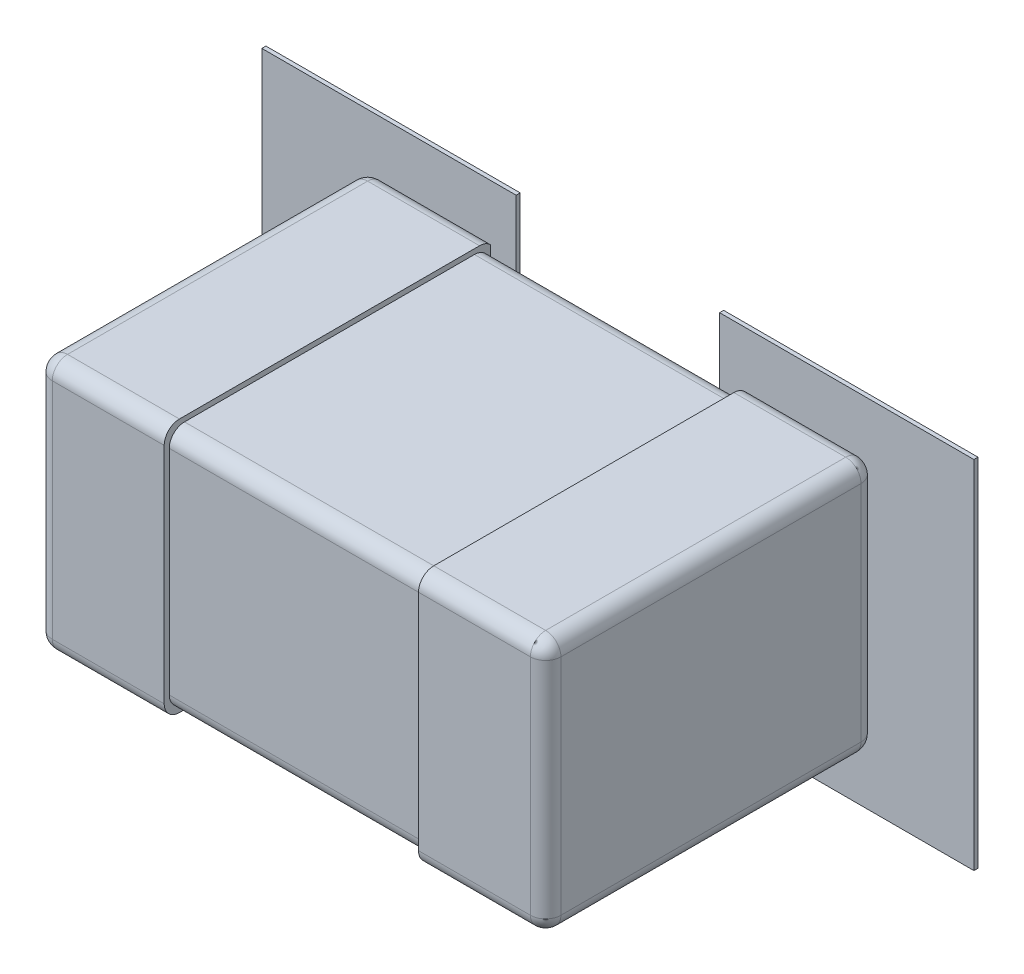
ISO-10303-21;
HEADER;
FILE_DESCRIPTION(('STEP AP214'),'2;1');
FILE_NAME('part.step','',(''),(''),'','','');
FILE_SCHEMA(('AUTOMOTIVE_DESIGN { 1 0 10303 214 1 1 1 1 }'));
ENDSEC;
DATA;
#1=APPLICATION_CONTEXT('core data for automotive mechanical design processes');
#2=APPLICATION_PROTOCOL_DEFINITION('international standard','automotive_design',2000,#1);
#3=PRODUCT_CONTEXT('',#1,'mechanical');
#4=PRODUCT('Part','Part','',(#3));
#5=PRODUCT_RELATED_PRODUCT_CATEGORY('part','',(#4));
#6=PRODUCT_DEFINITION_FORMATION('','',#4);
#7=PRODUCT_DEFINITION_CONTEXT('part definition',#1,'design');
#8=PRODUCT_DEFINITION('design','',#6,#7);
#9=PRODUCT_DEFINITION_SHAPE('','',#8);
#10=(LENGTH_UNIT() NAMED_UNIT(*) SI_UNIT(.MILLI.,.METRE.));
#11=(NAMED_UNIT(*) PLANE_ANGLE_UNIT() SI_UNIT($,.RADIAN.));
#12=(NAMED_UNIT(*) SI_UNIT($,.STERADIAN.) SOLID_ANGLE_UNIT());
#13=UNCERTAINTY_MEASURE_WITH_UNIT(LENGTH_MEASURE(1.E-05),#10,'distance_accuracy_value','');
#14=(GEOMETRIC_REPRESENTATION_CONTEXT(3) GLOBAL_UNCERTAINTY_ASSIGNED_CONTEXT((#13)) GLOBAL_UNIT_ASSIGNED_CONTEXT((#10,
#11,#12)) REPRESENTATION_CONTEXT('',''));
#15=CARTESIAN_POINT('',(0.,0.,0.));
#16=DIRECTION('',(0.,0.,1.));
#17=DIRECTION('',(1.,0.,0.));
#18=AXIS2_PLACEMENT_3D('',#15,#16,#17);
#19=CARTESIAN_POINT('',(0.,0.,0.0762));
#20=DIRECTION('',(0.,0.,1.));
#21=DIRECTION('',(1.,0.,0.));
#22=AXIS2_PLACEMENT_3D('',#19,#20,#21);
#23=PLANE('',#22);
#24=DIRECTION('',(0.,1.,0.));
#25=VECTOR('',#24,1.);
#26=CARTESIAN_POINT('',(0.199999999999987,0.350000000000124,0.0762));
#27=LINE('',#26,#25);
#28=CARTESIAN_POINT('',(0.199999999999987,0.350000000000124,0.0762));
#29=VERTEX_POINT('',#28);
#30=CARTESIAN_POINT('',(0.199999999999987,-0.350000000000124,0.0762));
#31=VERTEX_POINT('',#30);
#32=EDGE_CURVE('E378',#29,#31,#27,.F.);
#33=ORIENTED_EDGE('',*,*,#32,.F.);
#34=DIRECTION('',(1.,0.,0.));
#35=VECTOR('',#34,1.);
#36=CARTESIAN_POINT('',(0.699999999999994,0.350000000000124,0.0762));
#37=LINE('',#36,#35);
#38=CARTESIAN_POINT('',(0.699999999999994,0.350000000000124,0.0762));
#39=VERTEX_POINT('',#38);
#40=EDGE_CURVE('E383',#39,#29,#37,.F.);
#41=ORIENTED_EDGE('',*,*,#40,.F.);
#42=DIRECTION('',(0.,1.,0.));
#43=VECTOR('',#42,1.);
#44=CARTESIAN_POINT('',(0.699999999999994,-0.350000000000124,0.0762));
#45=LINE('',#44,#43);
#46=CARTESIAN_POINT('',(0.699999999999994,-0.350000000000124,0.0762));
#47=VERTEX_POINT('',#46);
#48=EDGE_CURVE('E367',#47,#39,#45,.T.);
#49=ORIENTED_EDGE('',*,*,#48,.F.);
#50=DIRECTION('',(1.,0.,0.));
#51=VECTOR('',#50,1.);
#52=CARTESIAN_POINT('',(0.199999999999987,-0.350000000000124,0.0762));
#53=LINE('',#52,#51);
#54=EDGE_CURVE('E62',#31,#47,#53,.T.);
#55=ORIENTED_EDGE('',*,*,#54,.F.);
#56=EDGE_LOOP('',(#33,#41,#49,#55));
#57=FACE_BOUND('',#56,.T.);
#58=ADVANCED_FACE('F16',(#57),#23,.F.);
#59=CARTESIAN_POINT('',(0.500000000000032,-0.249999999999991,0.0762));
#60=DIRECTION('',(1.,0.,0.));
#61=DIRECTION('',(0.,0.,-1.));
#62=AXIS2_PLACEMENT_3D('',#59,#60,#61);
#63=PLANE('',#62);
#64=DIRECTION('',(0.,0.,-1.));
#65=VECTOR('',#64,1.);
#66=CARTESIAN_POINT('',(0.499999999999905,-0.220000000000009,1.5735077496));
#67=LINE('',#66,#65);
#68=CARTESIAN_POINT('',(0.499999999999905,-0.220000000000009,0.106200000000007));
#69=VERTEX_POINT('',#68);
#70=CARTESIAN_POINT('',(0.499999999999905,-0.220000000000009,0.69618600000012));
#71=VERTEX_POINT('',#70);
#72=EDGE_CURVE('E385',#69,#71,#67,.F.);
#73=ORIENTED_EDGE('',*,*,#72,.F.);
#74=DIRECTION('',(0.,-1.,0.));
#75=VECTOR('',#74,1.);
#76=CARTESIAN_POINT('',(0.499999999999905,1.26251999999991,0.106200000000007));
#77=LINE('',#76,#75);
#78=CARTESIAN_POINT('',(0.499999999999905,0.220000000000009,0.106200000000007));
#79=VERTEX_POINT('',#78);
#80=EDGE_CURVE('E53',#79,#69,#77,.T.);
#81=ORIENTED_EDGE('',*,*,#80,.F.);
#82=DIRECTION('',(0.,0.,-1.));
#83=VECTOR('',#82,1.);
#84=CARTESIAN_POINT('',(0.499999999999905,0.220000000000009,1.5735077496));
#85=LINE('',#84,#83);
#86=CARTESIAN_POINT('',(0.499999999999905,0.220000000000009,0.69618600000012));
#87=VERTEX_POINT('',#86);
#88=EDGE_CURVE('E394',#87,#79,#85,.T.);
#89=ORIENTED_EDGE('',*,*,#88,.F.);
#90=DIRECTION('',(0.,1.,0.));
#91=VECTOR('',#90,1.);
#92=CARTESIAN_POINT('',(0.499999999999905,-1.26251999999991,0.69618600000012));
#93=LINE('',#92,#91);
#94=EDGE_CURVE('E391',#71,#87,#93,.T.);
#95=ORIENTED_EDGE('',*,*,#94,.F.);
#96=EDGE_LOOP('',(#73,#81,#89,#95));
#97=FACE_BOUND('',#96,.T.);
#98=ADVANCED_FACE('F802',(#97),#63,.T.);
#99=CARTESIAN_POINT('',(0.699999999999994,0.350000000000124,0.0762));
#100=DIRECTION('',(0.,1.,0.));
#101=DIRECTION('',(0.,0.,1.));
#102=AXIS2_PLACEMENT_3D('',#99,#100,#101);
#103=PLANE('',#102);
#104=DIRECTION('',(0.,0.,-1.));
#105=VECTOR('',#104,1.);
#106=CARTESIAN_POINT('',(0.699999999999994,0.350000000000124,0.0762));
#107=LINE('',#106,#105);
#108=CARTESIAN_POINT('',(0.699999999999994,0.350000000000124,0.0841999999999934));
#109=VERTEX_POINT('',#108);
#110=EDGE_CURVE('E372',#39,#109,#107,.F.);
#111=ORIENTED_EDGE('',*,*,#110,.F.);
#112=ORIENTED_EDGE('',*,*,#40,.T.);
#113=DIRECTION('',(0.,0.,1.));
#114=VECTOR('',#113,1.);
#115=CARTESIAN_POINT('',(0.199999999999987,0.350000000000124,0.0762));
#116=LINE('',#115,#114);
#117=CARTESIAN_POINT('',(0.199999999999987,0.350000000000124,0.0841999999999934));
#118=VERTEX_POINT('',#117);
#119=EDGE_CURVE('E380',#118,#29,#116,.F.);
#120=ORIENTED_EDGE('',*,*,#119,.F.);
#121=DIRECTION('',(1.,0.,0.));
#122=VECTOR('',#121,1.);
#123=CARTESIAN_POINT('',(0.,0.350000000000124,0.0841999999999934));
#124=LINE('',#123,#122);
#125=EDGE_CURVE('E316',#109,#118,#124,.F.);
#126=ORIENTED_EDGE('',*,*,#125,.F.);
#127=EDGE_LOOP('',(#111,#112,#120,#126));
#128=FACE_BOUND('',#127,.T.);
#129=ADVANCED_FACE('F818',(#128),#103,.T.);
#130=CARTESIAN_POINT('',(0.199999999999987,0.350000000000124,0.0762));
#131=DIRECTION('',(-1.,0.,0.));
#132=DIRECTION('',(0.,0.,1.));
#133=AXIS2_PLACEMENT_3D('',#130,#131,#132);
#134=PLANE('',#133);
#135=ORIENTED_EDGE('',*,*,#119,.T.);
#136=ORIENTED_EDGE('',*,*,#32,.T.);
#137=DIRECTION('',(0.,0.,-1.));
#138=VECTOR('',#137,1.);
#139=CARTESIAN_POINT('',(0.199999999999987,-0.350000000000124,0.0762));
#140=LINE('',#139,#138);
#141=CARTESIAN_POINT('',(0.199999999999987,-0.350000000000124,0.0841999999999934));
#142=VERTEX_POINT('',#141);
#143=EDGE_CURVE('E376',#142,#31,#140,.T.);
#144=ORIENTED_EDGE('',*,*,#143,.F.);
#145=DIRECTION('',(0.,1.,0.));
#146=VECTOR('',#145,1.);
#147=CARTESIAN_POINT('',(0.199999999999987,0.,0.0841999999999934));
#148=LINE('',#147,#146);
#149=EDGE_CURVE('E313',#118,#142,#148,.F.);
#150=ORIENTED_EDGE('',*,*,#149,.F.);
#151=EDGE_LOOP('',(#135,#136,#144,#150));
#152=FACE_BOUND('',#151,.T.);
#153=ADVANCED_FACE('F821',(#152),#134,.T.);
#154=CARTESIAN_POINT('',(0.199999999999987,-0.350000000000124,0.0762));
#155=DIRECTION('',(0.,-1.,0.));
#156=DIRECTION('',(0.,0.,-1.));
#157=AXIS2_PLACEMENT_3D('',#154,#155,#156);
#158=PLANE('',#157);
#159=ORIENTED_EDGE('',*,*,#143,.T.);
#160=ORIENTED_EDGE('',*,*,#54,.T.);
#161=DIRECTION('',(0.,0.,-1.));
#162=VECTOR('',#161,1.);
#163=CARTESIAN_POINT('',(0.699999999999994,-0.350000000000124,0.0762));
#164=LINE('',#163,#162);
#165=CARTESIAN_POINT('',(0.699999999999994,-0.350000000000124,0.0841999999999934));
#166=VERTEX_POINT('',#165);
#167=EDGE_CURVE('E370',#166,#47,#164,.T.);
#168=ORIENTED_EDGE('',*,*,#167,.F.);
#169=DIRECTION('',(1.,0.,0.));
#170=VECTOR('',#169,1.);
#171=CARTESIAN_POINT('',(0.,-0.350000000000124,0.0841999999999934));
#172=LINE('',#171,#170);
#173=EDGE_CURVE('E310',#142,#166,#172,.T.);
#174=ORIENTED_EDGE('',*,*,#173,.F.);
#175=EDGE_LOOP('',(#159,#160,#168,#174));
#176=FACE_BOUND('',#175,.T.);
#177=ADVANCED_FACE('F822',(#176),#158,.T.);
#178=CARTESIAN_POINT('',(0.699999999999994,-0.350000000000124,0.0762));
#179=DIRECTION('',(1.,0.,0.));
#180=DIRECTION('',(0.,0.,-1.));
#181=AXIS2_PLACEMENT_3D('',#178,#179,#180);
#182=PLANE('',#181);
#183=ORIENTED_EDGE('',*,*,#167,.T.);
#184=ORIENTED_EDGE('',*,*,#48,.T.);
#185=ORIENTED_EDGE('',*,*,#110,.T.);
#186=DIRECTION('',(0.,1.,0.));
#187=VECTOR('',#186,1.);
#188=CARTESIAN_POINT('',(0.699999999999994,0.,0.0841999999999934));
#189=LINE('',#188,#187);
#190=EDGE_CURVE('E307',#166,#109,#189,.T.);
#191=ORIENTED_EDGE('',*,*,#190,.F.);
#192=EDGE_LOOP('',(#183,#184,#185,#191));
#193=FACE_BOUND('',#192,.T.);
#194=ADVANCED_FACE('F824',(#193),#182,.T.);
#195=CARTESIAN_POINT('',(0.469999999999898,1.26251999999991,0.106200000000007));
#196=DIRECTION('',(0.,-1.,0.));
#197=DIRECTION('',(0.,0.,-1.));
#198=AXIS2_PLACEMENT_3D('',#195,#196,#197);
#199=CYLINDRICAL_SURFACE('',#198,0.030000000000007);
#200=CARTESIAN_POINT('',(0.469999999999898,-0.220000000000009,0.106200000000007));
#201=DIRECTION('',(0.,-1.,0.));
#202=DIRECTION('',(0.,0.,-1.));
#203=AXIS2_PLACEMENT_3D('',#200,#201,#202);
#204=CIRCLE('',#203,0.030000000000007);
#205=CARTESIAN_POINT('',(0.490396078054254,-0.220000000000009,0.0841999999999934));
#206=VERTEX_POINT('',#205);
#207=EDGE_CURVE('E388',#206,#69,#204,.T.);
#208=ORIENTED_EDGE('',*,*,#207,.F.);
#209=DIRECTION('',(0.,1.,0.));
#210=VECTOR('',#209,1.);
#211=CARTESIAN_POINT('',(0.490396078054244,0.,0.0841999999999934));
#212=LINE('',#211,#210);
#213=CARTESIAN_POINT('',(0.490396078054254,0.220000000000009,0.0841999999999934));
#214=VERTEX_POINT('',#213);
#215=EDGE_CURVE('E303',#214,#206,#212,.F.);
#216=ORIENTED_EDGE('',*,*,#215,.F.);
#217=CARTESIAN_POINT('',(0.469999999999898,0.220000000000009,0.106200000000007));
#218=DIRECTION('',(0.,-1.,0.));
#219=DIRECTION('',(0.,0.,-1.));
#220=AXIS2_PLACEMENT_3D('',#217,#218,#219);
#221=CIRCLE('',#220,0.030000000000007);
#222=EDGE_CURVE('E19',#79,#214,#221,.F.);
#223=ORIENTED_EDGE('',*,*,#222,.F.);
#224=ORIENTED_EDGE('',*,*,#80,.T.);
#225=EDGE_LOOP('',(#208,#216,#223,#224));
#226=FACE_BOUND('',#225,.T.);
#227=ADVANCED_FACE('F359',(#226),#199,.T.);
#228=CARTESIAN_POINT('',(0.469999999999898,0.220000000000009,0.106200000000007));
#229=DIRECTION('',(0.707106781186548,0.707106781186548,0.));
#230=DIRECTION('',(0.,0.,-1.));
#231=AXIS2_PLACEMENT_3D('',#228,#229,#230);
#232=SPHERICAL_SURFACE('',#231,0.030000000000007);
#233=ORIENTED_EDGE('',*,*,#222,.T.);
#234=CARTESIAN_POINT('',(0.469999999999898,0.240396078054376,0.0841999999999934));
#235=CARTESIAN_POINT('',(0.472298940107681,0.240411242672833,0.0841999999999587));
#236=CARTESIAN_POINT('',(0.474588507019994,0.240009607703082,0.0841999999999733));
#237=CARTESIAN_POINT('',(0.478913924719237,0.238483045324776,0.0842000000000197));
#238=CARTESIAN_POINT('',(0.480949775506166,0.237358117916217,0.0842000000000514));
#239=CARTESIAN_POINT('',(0.484532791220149,0.234495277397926,0.0842000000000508));
#240=CARTESIAN_POINT('',(0.486079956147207,0.2327573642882,0.0842000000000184));
#241=CARTESIAN_POINT('',(0.48850977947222,0.228865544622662,0.0842000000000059));
#242=CARTESIAN_POINT('',(0.489392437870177,0.226711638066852,0.0842000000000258));
#243=CARTESIAN_POINT('',(0.490231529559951,0.223007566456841,0.0842000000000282));
#244=CARTESIAN_POINT('',(0.490401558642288,0.221503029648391,0.0842000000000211));
#245=CARTESIAN_POINT('',(0.490396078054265,0.220000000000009,0.0841999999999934));
#246=B_SPLINE_CURVE_WITH_KNOTS('',3,(#234,#235,#236,#237,#238,#239,#240,#241,#242,#243,#244,
#245),.UNSPECIFIED.,.F.,.F.,(4,2,2,2,2,4),(0.,0.00684841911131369,0.0136968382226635,
0.0205452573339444,0.0273936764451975,0.0318985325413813),.UNSPECIFIED.);
#247=CARTESIAN_POINT('',(0.469999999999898,0.240396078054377,0.0841999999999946));
#248=VERTEX_POINT('',#247);
#249=EDGE_CURVE('E306',#248,#214,#246,.T.);
#250=ORIENTED_EDGE('',*,*,#249,.F.);
#251=CARTESIAN_POINT('',(0.469999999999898,0.220000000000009,0.106200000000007));
#252=DIRECTION('',(1.,0.,0.));
#253=DIRECTION('',(0.,0.,-1.));
#254=AXIS2_PLACEMENT_3D('',#251,#252,#253);
#255=CIRCLE('',#254,0.030000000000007);
#256=CARTESIAN_POINT('',(0.469999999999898,0.250000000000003,0.106200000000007));
#257=VERTEX_POINT('',#256);
#258=EDGE_CURVE('E302',#257,#248,#255,.F.);
#259=ORIENTED_EDGE('',*,*,#258,.F.);
#260=CARTESIAN_POINT('',(0.469999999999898,0.220000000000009,0.106200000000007));
#261=DIRECTION('',(0.,0.,-1.));
#262=DIRECTION('',(-1.,0.,0.));
#263=AXIS2_PLACEMENT_3D('',#260,#261,#262);
#264=CIRCLE('',#263,0.030000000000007);
#265=CARTESIAN_POINT('',(0.491213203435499,0.24121320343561,0.106200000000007));
#266=VERTEX_POINT('',#265);
#267=EDGE_CURVE('E269',#266,#257,#264,.F.);
#268=ORIENTED_EDGE('',*,*,#267,.F.);
#269=CARTESIAN_POINT('',(0.469999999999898,0.220000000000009,0.106200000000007));
#270=DIRECTION('',(0.,0.,-1.));
#271=DIRECTION('',(-1.,0.,0.));
#272=AXIS2_PLACEMENT_3D('',#269,#270,#271);
#273=CIRCLE('',#272,0.030000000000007);
#274=EDGE_CURVE('E34',#79,#266,#273,.F.);
#275=ORIENTED_EDGE('',*,*,#274,.F.);
#276=EDGE_LOOP('',(#233,#250,#259,#268,#275));
#277=FACE_BOUND('',#276,.T.);
#278=ADVANCED_FACE('F353',(#277),#232,.T.);
#279=CARTESIAN_POINT('',(0.469999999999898,0.220000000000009,1.5735077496));
#280=DIRECTION('',(0.,0.,-1.));
#281=DIRECTION('',(-1.,0.,0.));
#282=AXIS2_PLACEMENT_3D('',#279,#280,#281);
#283=CYLINDRICAL_SURFACE('',#282,0.030000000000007);
#284=ORIENTED_EDGE('',*,*,#267,.T.);
#285=DIRECTION('',(0.,0.,1.));
#286=VECTOR('',#285,1.);
#287=CARTESIAN_POINT('',(0.469999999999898,0.249999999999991,0.0762));
#288=LINE('',#287,#286);
#289=CARTESIAN_POINT('',(0.469999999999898,0.250000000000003,0.69618600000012));
#290=VERTEX_POINT('',#289);
#291=EDGE_CURVE('E281',#290,#257,#288,.F.);
#292=ORIENTED_EDGE('',*,*,#291,.F.);
#293=CARTESIAN_POINT('',(0.469999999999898,0.220000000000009,0.69618600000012));
#294=DIRECTION('',(0.,0.,-1.));
#295=DIRECTION('',(-1.,0.,0.));
#296=AXIS2_PLACEMENT_3D('',#293,#294,#295);
#297=CIRCLE('',#296,0.030000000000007);
#298=EDGE_CURVE('E264',#87,#290,#297,.F.);
#299=ORIENTED_EDGE('',*,*,#298,.F.);
#300=ORIENTED_EDGE('',*,*,#88,.T.);
#301=ORIENTED_EDGE('',*,*,#274,.T.);
#302=EDGE_LOOP('',(#284,#292,#299,#300,#301));
#303=FACE_BOUND('',#302,.T.);
#304=ADVANCED_FACE('F282',(#303),#283,.T.);
#305=CARTESIAN_POINT('',(0.469999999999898,0.220000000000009,0.69618600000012));
#306=DIRECTION('',(0.,0.707106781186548,0.707106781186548));
#307=DIRECTION('',(1.,0.,0.));
#308=AXIS2_PLACEMENT_3D('',#305,#306,#307);
#309=SPHERICAL_SURFACE('',#308,0.030000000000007);
#310=CARTESIAN_POINT('',(0.469999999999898,0.220000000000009,0.69618600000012));
#311=DIRECTION('',(0.,1.,0.));
#312=DIRECTION('',(0.,0.,1.));
#313=AXIS2_PLACEMENT_3D('',#310,#311,#312);
#314=CIRCLE('',#313,0.030000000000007);
#315=CARTESIAN_POINT('',(0.469999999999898,0.220000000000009,0.726186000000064));
#316=VERTEX_POINT('',#315);
#317=EDGE_CURVE('E258',#87,#316,#314,.F.);
#318=ORIENTED_EDGE('',*,*,#317,.F.);
#319=ORIENTED_EDGE('',*,*,#298,.T.);
#320=CARTESIAN_POINT('',(0.469999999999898,0.220000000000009,0.69618600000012));
#321=DIRECTION('',(-1.,0.,0.));
#322=DIRECTION('',(0.,0.,1.));
#323=AXIS2_PLACEMENT_3D('',#320,#321,#322);
#324=CIRCLE('',#323,0.030000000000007);
#325=CARTESIAN_POINT('',(0.469999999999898,0.24121320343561,0.717399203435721));
#326=VERTEX_POINT('',#325);
#327=EDGE_CURVE('E267',#326,#290,#324,.T.);
#328=ORIENTED_EDGE('',*,*,#327,.F.);
#329=CARTESIAN_POINT('',(0.469999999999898,0.220000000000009,0.69618600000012));
#330=DIRECTION('',(-1.,0.,0.));
#331=DIRECTION('',(0.,0.,1.));
#332=AXIS2_PLACEMENT_3D('',#329,#330,#331);
#333=CIRCLE('',#332,0.030000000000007);
#334=EDGE_CURVE('E278',#316,#326,#333,.T.);
#335=ORIENTED_EDGE('',*,*,#334,.F.);
#336=EDGE_LOOP('',(#318,#319,#328,#335));
#337=FACE_BOUND('',#336,.T.);
#338=ADVANCED_FACE('F266',(#337),#309,.T.);
#339=CARTESIAN_POINT('',(0.469999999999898,-1.26251999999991,0.69618600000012));
#340=DIRECTION('',(0.,1.,0.));
#341=DIRECTION('',(0.,0.,1.));
#342=AXIS2_PLACEMENT_3D('',#339,#340,#341);
#343=CYLINDRICAL_SURFACE('',#342,0.030000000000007);
#344=CARTESIAN_POINT('',(0.469999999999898,-0.220000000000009,0.69618600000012));
#345=DIRECTION('',(0.,1.,0.));
#346=DIRECTION('',(0.,0.,1.));
#347=AXIS2_PLACEMENT_3D('',#344,#345,#346);
#348=CIRCLE('',#347,0.030000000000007);
#349=CARTESIAN_POINT('',(0.491213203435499,-0.220000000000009,0.717399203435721));
#350=VERTEX_POINT('',#349);
#351=EDGE_CURVE('E393',#71,#350,#348,.F.);
#352=ORIENTED_EDGE('',*,*,#351,.F.);
#353=ORIENTED_EDGE('',*,*,#94,.T.);
#354=ORIENTED_EDGE('',*,*,#317,.T.);
#355=DIRECTION('',(0.,1.,0.));
#356=VECTOR('',#355,1.);
#357=CARTESIAN_POINT('',(0.469999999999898,0.,0.726186));
#358=LINE('',#357,#356);
#359=CARTESIAN_POINT('',(0.469999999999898,-0.220000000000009,0.726186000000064));
#360=VERTEX_POINT('',#359);
#361=EDGE_CURVE('E292',#360,#316,#358,.T.);
#362=ORIENTED_EDGE('',*,*,#361,.F.);
#363=CARTESIAN_POINT('',(0.469999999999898,-0.220000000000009,0.69618600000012));
#364=DIRECTION('',(0.,-1.,0.));
#365=DIRECTION('',(0.707106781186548,0.,0.707106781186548));
#366=AXIS2_PLACEMENT_3D('',#363,#364,#365);
#367=CIRCLE('',#366,0.030000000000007);
#368=EDGE_CURVE('E777',#350,#360,#367,.T.);
#369=ORIENTED_EDGE('',*,*,#368,.F.);
#370=EDGE_LOOP('',(#352,#353,#354,#362,#369));
#371=FACE_BOUND('',#370,.T.);
#372=ADVANCED_FACE('F788',(#371),#343,.T.);
#373=CARTESIAN_POINT('',(0.469999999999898,-0.220000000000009,0.69618600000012));
#374=DIRECTION('',(0.707106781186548,0.,0.707106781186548));
#375=DIRECTION('',(0.,-1.,0.));
#376=AXIS2_PLACEMENT_3D('',#373,#374,#375);
#377=SPHERICAL_SURFACE('',#376,0.030000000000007);
#378=ORIENTED_EDGE('',*,*,#351,.T.);
#379=ORIENTED_EDGE('',*,*,#368,.T.);
#380=CARTESIAN_POINT('',(0.469999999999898,-0.220000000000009,0.69618600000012));
#381=DIRECTION('',(1.,0.,0.));
#382=DIRECTION('',(0.,0.,-1.));
#383=AXIS2_PLACEMENT_3D('',#380,#381,#382);
#384=CIRCLE('',#383,0.030000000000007);
#385=CARTESIAN_POINT('',(0.469999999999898,-0.250000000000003,0.69618600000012));
#386=VERTEX_POINT('',#385);
#387=EDGE_CURVE('E760',#386,#360,#384,.F.);
#388=ORIENTED_EDGE('',*,*,#387,.F.);
#389=CARTESIAN_POINT('',(0.469999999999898,-0.220000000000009,0.69618600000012));
#390=DIRECTION('',(0.,0.,-1.));
#391=DIRECTION('',(-1.,0.,0.));
#392=AXIS2_PLACEMENT_3D('',#389,#390,#391);
#393=CIRCLE('',#392,0.030000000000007);
#394=EDGE_CURVE('E389',#71,#386,#393,.T.);
#395=ORIENTED_EDGE('',*,*,#394,.F.);
#396=EDGE_LOOP('',(#378,#379,#388,#395));
#397=FACE_BOUND('',#396,.T.);
#398=ADVANCED_FACE('F775',(#397),#377,.T.);
#399=CARTESIAN_POINT('',(0.469999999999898,-0.220000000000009,1.5735077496));
#400=DIRECTION('',(0.,0.,-1.));
#401=DIRECTION('',(-1.,0.,0.));
#402=AXIS2_PLACEMENT_3D('',#399,#400,#401);
#403=CYLINDRICAL_SURFACE('',#402,0.030000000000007);
#404=CARTESIAN_POINT('',(0.469999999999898,-0.220000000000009,0.106200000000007));
#405=DIRECTION('',(0.,0.,-1.));
#406=DIRECTION('',(-1.,0.,0.));
#407=AXIS2_PLACEMENT_3D('',#404,#405,#406);
#408=CIRCLE('',#407,0.030000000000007);
#409=CARTESIAN_POINT('',(0.491213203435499,-0.24121320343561,0.106200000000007));
#410=VERTEX_POINT('',#409);
#411=EDGE_CURVE('E351',#69,#410,#408,.T.);
#412=ORIENTED_EDGE('',*,*,#411,.F.);
#413=ORIENTED_EDGE('',*,*,#72,.T.);
#414=ORIENTED_EDGE('',*,*,#394,.T.);
#415=DIRECTION('',(0.,0.,-1.));
#416=VECTOR('',#415,1.);
#417=CARTESIAN_POINT('',(0.469999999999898,-0.249999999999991,0.0762));
#418=LINE('',#417,#416);
#419=CARTESIAN_POINT('',(0.469999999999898,-0.250000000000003,0.106200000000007));
#420=VERTEX_POINT('',#419);
#421=EDGE_CURVE('E320',#420,#386,#418,.F.);
#422=ORIENTED_EDGE('',*,*,#421,.F.);
#423=CARTESIAN_POINT('',(0.469999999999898,-0.220000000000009,0.106200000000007));
#424=DIRECTION('',(0.,0.,-1.));
#425=DIRECTION('',(0.707106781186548,-0.707106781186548,0.));
#426=AXIS2_PLACEMENT_3D('',#423,#424,#425);
#427=CIRCLE('',#426,0.030000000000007);
#428=EDGE_CURVE('E319',#410,#420,#427,.T.);
#429=ORIENTED_EDGE('',*,*,#428,.F.);
#430=EDGE_LOOP('',(#412,#413,#414,#422,#429));
#431=FACE_BOUND('',#430,.T.);
#432=ADVANCED_FACE('F334',(#431),#403,.T.);
#433=CARTESIAN_POINT('',(0.469999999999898,-0.220000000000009,0.106200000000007));
#434=DIRECTION('',(0.707106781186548,-0.707106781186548,0.));
#435=DIRECTION('',(0.,0.,-1.));
#436=AXIS2_PLACEMENT_3D('',#433,#434,#435);
#437=SPHERICAL_SURFACE('',#436,0.030000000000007);
#438=CARTESIAN_POINT('',(0.469999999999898,-0.220000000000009,0.106200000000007));
#439=DIRECTION('',(-1.,0.,0.));
#440=DIRECTION('',(0.,0.,1.));
#441=AXIS2_PLACEMENT_3D('',#438,#439,#440);
#442=CIRCLE('',#441,0.030000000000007);
#443=CARTESIAN_POINT('',(0.469999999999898,-0.240396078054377,0.0841999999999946));
#444=VERTEX_POINT('',#443);
#445=EDGE_CURVE('E756',#444,#420,#442,.T.);
#446=ORIENTED_EDGE('',*,*,#445,.F.);
#447=CARTESIAN_POINT('',(0.490396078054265,-0.220000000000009,0.0841999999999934));
#448=CARTESIAN_POINT('',(0.490411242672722,-0.222298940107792,0.0841999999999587));
#449=CARTESIAN_POINT('',(0.490009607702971,-0.224588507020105,0.0841999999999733));
#450=CARTESIAN_POINT('',(0.488483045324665,-0.228913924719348,0.0842000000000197));
#451=CARTESIAN_POINT('',(0.487358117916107,-0.230949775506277,0.0842000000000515));
#452=CARTESIAN_POINT('',(0.484495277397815,-0.234532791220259,0.0842000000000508));
#453=CARTESIAN_POINT('',(0.482757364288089,-0.236079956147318,0.0842000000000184));
#454=CARTESIAN_POINT('',(0.478865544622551,-0.238509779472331,0.0842000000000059));
#455=CARTESIAN_POINT('',(0.476711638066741,-0.239392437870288,0.0842000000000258));
#456=CARTESIAN_POINT('',(0.47300756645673,-0.240231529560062,0.0842000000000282));
#457=CARTESIAN_POINT('',(0.47150302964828,-0.240401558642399,0.0842000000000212));
#458=CARTESIAN_POINT('',(0.469999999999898,-0.240396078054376,0.0841999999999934));
#459=B_SPLINE_CURVE_WITH_KNOTS('',3,(#447,#448,#449,#450,#451,#452,#453,#454,#455,#456,#457,
#458),.UNSPECIFIED.,.F.,.F.,(4,2,2,2,2,4),(0.,0.00684841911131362,0.0136968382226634,
0.0205452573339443,0.0273936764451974,0.0318985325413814),.UNSPECIFIED.);
#460=EDGE_CURVE('E305',#206,#444,#459,.T.);
#461=ORIENTED_EDGE('',*,*,#460,.F.);
#462=ORIENTED_EDGE('',*,*,#207,.T.);
#463=ORIENTED_EDGE('',*,*,#411,.T.);
#464=ORIENTED_EDGE('',*,*,#428,.T.);
#465=EDGE_LOOP('',(#446,#461,#462,#463,#464));
#466=FACE_BOUND('',#465,.T.);
#467=ADVANCED_FACE('F328',(#466),#437,.T.);
#468=CARTESIAN_POINT('',(0.,0.,0.0841999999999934));
#469=DIRECTION('',(0.,0.,1.));
#470=DIRECTION('',(1.,0.,0.));
#471=AXIS2_PLACEMENT_3D('',#468,#469,#470);
#472=PLANE('',#471);
#473=DIRECTION('',(-1.,0.,0.));
#474=VECTOR('',#473,1.);
#475=CARTESIAN_POINT('',(2.52504000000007,-0.240396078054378,0.0841999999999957));
#476=LINE('',#475,#474);
#477=CARTESIAN_POINT('',(0.249999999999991,-0.240396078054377,0.0841999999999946));
#478=VERTEX_POINT('',#477);
#479=EDGE_CURVE('E686',#478,#444,#476,.F.);
#480=ORIENTED_EDGE('',*,*,#479,.F.);
#481=DIRECTION('',(0.,1.,0.));
#482=VECTOR('',#481,1.);
#483=CARTESIAN_POINT('',(0.249999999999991,-0.249999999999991,0.0841999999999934));
#484=LINE('',#483,#482);
#485=CARTESIAN_POINT('',(0.249999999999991,0.240396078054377,0.0841999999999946));
#486=VERTEX_POINT('',#485);
#487=EDGE_CURVE('E684',#478,#486,#484,.T.);
#488=ORIENTED_EDGE('',*,*,#487,.T.);
#489=DIRECTION('',(1.,0.,0.));
#490=VECTOR('',#489,1.);
#491=CARTESIAN_POINT('',(-2.52504000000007,0.240396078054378,0.0841999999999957));
#492=LINE('',#491,#490);
#493=EDGE_CURVE('E286',#248,#486,#492,.F.);
#494=ORIENTED_EDGE('',*,*,#493,.F.);
#495=ORIENTED_EDGE('',*,*,#249,.T.);
#496=ORIENTED_EDGE('',*,*,#215,.T.);
#497=ORIENTED_EDGE('',*,*,#460,.T.);
#498=EDGE_LOOP('',(#480,#488,#494,#495,#496,#497));
#499=FACE_BOUND('',#498,.T.);
#500=ORIENTED_EDGE('',*,*,#173,.T.);
#501=ORIENTED_EDGE('',*,*,#190,.T.);
#502=ORIENTED_EDGE('',*,*,#125,.T.);
#503=ORIENTED_EDGE('',*,*,#149,.T.);
#504=EDGE_LOOP('',(#500,#501,#502,#503));
#505=FACE_BOUND('',#504,.T.);
#506=ADVANCED_FACE('F333',(#499,#505),#472,.T.);
#507=CARTESIAN_POINT('',(-2.52504000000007,0.220000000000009,0.106200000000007));
#508=DIRECTION('',(1.,0.,0.));
#509=DIRECTION('',(0.,0.,-1.));
#510=AXIS2_PLACEMENT_3D('',#507,#508,#509);
#511=CYLINDRICAL_SURFACE('',#510,0.030000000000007);
#512=ORIENTED_EDGE('',*,*,#258,.T.);
#513=ORIENTED_EDGE('',*,*,#493,.T.);
#514=CARTESIAN_POINT('',(0.249999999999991,0.220000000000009,0.106200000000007));
#515=DIRECTION('',(1.,0.,0.));
#516=DIRECTION('',(0.,0.,-1.));
#517=AXIS2_PLACEMENT_3D('',#514,#515,#516);
#518=CIRCLE('',#517,0.030000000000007);
#519=CARTESIAN_POINT('',(0.249999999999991,0.249999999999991,0.106200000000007));
#520=VERTEX_POINT('',#519);
#521=EDGE_CURVE('E690',#486,#520,#518,.T.);
#522=ORIENTED_EDGE('',*,*,#521,.T.);
#523=DIRECTION('',(1.,0.,0.));
#524=VECTOR('',#523,1.);
#525=CARTESIAN_POINT('',(0.500000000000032,0.249999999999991,0.106200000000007));
#526=LINE('',#525,#524);
#527=EDGE_CURVE('E285',#257,#520,#526,.F.);
#528=ORIENTED_EDGE('',*,*,#527,.F.);
#529=EDGE_LOOP('',(#512,#513,#522,#528));
#530=FACE_BOUND('',#529,.T.);
#531=ADVANCED_FACE('F666',(#530),#511,.T.);
#532=CARTESIAN_POINT('',(0.500000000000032,0.249999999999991,0.0762));
#533=DIRECTION('',(0.,1.,0.));
#534=DIRECTION('',(0.,0.,1.));
#535=AXIS2_PLACEMENT_3D('',#532,#533,#534);
#536=PLANE('',#535);
#537=DIRECTION('',(0.,0.,-1.));
#538=VECTOR('',#537,1.);
#539=CARTESIAN_POINT('',(0.249999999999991,0.249999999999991,0.0862000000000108));
#540=LINE('',#539,#538);
#541=CARTESIAN_POINT('',(0.249999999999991,0.250000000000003,0.69618600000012));
#542=VERTEX_POINT('',#541);
#543=EDGE_CURVE('E291',#520,#542,#540,.F.);
#544=ORIENTED_EDGE('',*,*,#543,.T.);
#545=DIRECTION('',(-1.,0.,0.));
#546=VECTOR('',#545,1.);
#547=CARTESIAN_POINT('',(2.52504000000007,0.250000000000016,0.69618600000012));
#548=LINE('',#547,#546);
#549=EDGE_CURVE('E275',#290,#542,#548,.T.);
#550=ORIENTED_EDGE('',*,*,#549,.F.);
#551=ORIENTED_EDGE('',*,*,#291,.T.);
#552=ORIENTED_EDGE('',*,*,#527,.T.);
#553=EDGE_LOOP('',(#544,#550,#551,#552));
#554=FACE_BOUND('',#553,.T.);
#555=ADVANCED_FACE('F289',(#554),#536,.T.);
#556=CARTESIAN_POINT('',(2.52504000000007,0.220000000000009,0.69618600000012));
#557=DIRECTION('',(-1.,0.,0.));
#558=DIRECTION('',(0.,0.,1.));
#559=AXIS2_PLACEMENT_3D('',#556,#557,#558);
#560=CYLINDRICAL_SURFACE('',#559,0.030000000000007);
#561=ORIENTED_EDGE('',*,*,#549,.T.);
#562=CARTESIAN_POINT('',(0.249999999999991,0.220000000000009,0.69618600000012));
#563=DIRECTION('',(-1.,0.,0.));
#564=DIRECTION('',(0.,0.,1.));
#565=AXIS2_PLACEMENT_3D('',#562,#563,#564);
#566=CIRCLE('',#565,0.030000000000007);
#567=CARTESIAN_POINT('',(0.249999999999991,0.220000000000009,0.726186));
#568=VERTEX_POINT('',#567);
#569=EDGE_CURVE('E747',#542,#568,#566,.F.);
#570=ORIENTED_EDGE('',*,*,#569,.T.);
#571=DIRECTION('',(1.,0.,0.));
#572=VECTOR('',#571,1.);
#573=CARTESIAN_POINT('',(0.,0.220000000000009,0.726186));
#574=LINE('',#573,#572);
#575=EDGE_CURVE('E295',#316,#568,#574,.F.);
#576=ORIENTED_EDGE('',*,*,#575,.F.);
#577=ORIENTED_EDGE('',*,*,#334,.T.);
#578=ORIENTED_EDGE('',*,*,#327,.T.);
#579=EDGE_LOOP('',(#561,#570,#576,#577,#578));
#580=FACE_BOUND('',#579,.T.);
#581=ADVANCED_FACE('F272',(#580),#560,.T.);
#582=CARTESIAN_POINT('',(0.,0.,0.726186));
#583=DIRECTION('',(0.,0.,1.));
#584=DIRECTION('',(1.,0.,0.));
#585=AXIS2_PLACEMENT_3D('',#582,#583,#584);
#586=PLANE('',#585);
#587=DIRECTION('',(0.,1.,0.));
#588=VECTOR('',#587,1.);
#589=CARTESIAN_POINT('',(0.249999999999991,-0.249999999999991,0.726186));
#590=LINE('',#589,#588);
#591=CARTESIAN_POINT('',(0.249999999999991,-0.220000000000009,0.726186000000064));
#592=VERTEX_POINT('',#591);
#593=EDGE_CURVE('E745',#568,#592,#590,.F.);
#594=ORIENTED_EDGE('',*,*,#593,.T.);
#595=DIRECTION('',(1.,0.,0.));
#596=VECTOR('',#595,1.);
#597=CARTESIAN_POINT('',(-2.52504000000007,-0.220000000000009,0.726186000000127));
#598=LINE('',#597,#596);
#599=EDGE_CURVE('E324',#360,#592,#598,.F.);
#600=ORIENTED_EDGE('',*,*,#599,.F.);
#601=ORIENTED_EDGE('',*,*,#361,.T.);
#602=ORIENTED_EDGE('',*,*,#575,.T.);
#603=EDGE_LOOP('',(#594,#600,#601,#602));
#604=FACE_BOUND('',#603,.T.);
#605=ADVANCED_FACE('F658',(#604),#586,.T.);
#606=CARTESIAN_POINT('',(-2.52504000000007,-0.220000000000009,0.69618600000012));
#607=DIRECTION('',(1.,0.,0.));
#608=DIRECTION('',(0.,0.,-1.));
#609=AXIS2_PLACEMENT_3D('',#606,#607,#608);
#610=CYLINDRICAL_SURFACE('',#609,0.030000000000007);
#611=ORIENTED_EDGE('',*,*,#599,.T.);
#612=CARTESIAN_POINT('',(0.249999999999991,-0.220000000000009,0.69618600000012));
#613=DIRECTION('',(1.,0.,0.));
#614=DIRECTION('',(0.,0.,-1.));
#615=AXIS2_PLACEMENT_3D('',#612,#613,#614);
#616=CIRCLE('',#615,0.030000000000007);
#617=CARTESIAN_POINT('',(0.249999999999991,-0.249999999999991,0.69618600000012));
#618=VERTEX_POINT('',#617);
#619=EDGE_CURVE('E744',#592,#618,#616,.T.);
#620=ORIENTED_EDGE('',*,*,#619,.T.);
#621=DIRECTION('',(1.,0.,0.));
#622=VECTOR('',#621,1.);
#623=CARTESIAN_POINT('',(-0.500000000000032,-0.249999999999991,0.69618600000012));
#624=LINE('',#623,#622);
#625=EDGE_CURVE('E323',#386,#618,#624,.F.);
#626=ORIENTED_EDGE('',*,*,#625,.F.);
#627=ORIENTED_EDGE('',*,*,#387,.T.);
#628=EDGE_LOOP('',(#611,#620,#626,#627));
#629=FACE_BOUND('',#628,.T.);
#630=ADVANCED_FACE('F654',(#629),#610,.T.);
#631=CARTESIAN_POINT('',(-0.500000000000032,-0.249999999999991,0.0762));
#632=DIRECTION('',(0.,-1.,0.));
#633=DIRECTION('',(0.,0.,-1.));
#634=AXIS2_PLACEMENT_3D('',#631,#632,#633);
#635=PLANE('',#634);
#636=ORIENTED_EDGE('',*,*,#421,.T.);
#637=ORIENTED_EDGE('',*,*,#625,.T.);
#638=DIRECTION('',(0.,0.,-1.));
#639=VECTOR('',#638,1.);
#640=CARTESIAN_POINT('',(0.249999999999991,-0.249999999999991,0.0862000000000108));
#641=LINE('',#640,#639);
#642=CARTESIAN_POINT('',(0.249999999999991,-0.250000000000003,0.106200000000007));
#643=VERTEX_POINT('',#642);
#644=EDGE_CURVE('E742',#618,#643,#641,.T.);
#645=ORIENTED_EDGE('',*,*,#644,.T.);
#646=DIRECTION('',(-1.,0.,0.));
#647=VECTOR('',#646,1.);
#648=CARTESIAN_POINT('',(2.52504000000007,-0.250000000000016,0.106200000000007));
#649=LINE('',#648,#647);
#650=EDGE_CURVE('E759',#420,#643,#649,.T.);
#651=ORIENTED_EDGE('',*,*,#650,.F.);
#652=EDGE_LOOP('',(#636,#637,#645,#651));
#653=FACE_BOUND('',#652,.T.);
#654=ADVANCED_FACE('F650',(#653),#635,.T.);
#655=CARTESIAN_POINT('',(2.52504000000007,-0.220000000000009,0.106200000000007));
#656=DIRECTION('',(-1.,0.,0.));
#657=DIRECTION('',(0.,0.,1.));
#658=AXIS2_PLACEMENT_3D('',#655,#656,#657);
#659=CYLINDRICAL_SURFACE('',#658,0.030000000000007);
#660=CARTESIAN_POINT('',(0.249999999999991,-0.220000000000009,0.106200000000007));
#661=DIRECTION('',(-1.,0.,0.));
#662=DIRECTION('',(0.,0.,1.));
#663=AXIS2_PLACEMENT_3D('',#660,#661,#662);
#664=CIRCLE('',#663,0.030000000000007);
#665=EDGE_CURVE('E730',#643,#478,#664,.F.);
#666=ORIENTED_EDGE('',*,*,#665,.T.);
#667=ORIENTED_EDGE('',*,*,#479,.T.);
#668=ORIENTED_EDGE('',*,*,#445,.T.);
#669=ORIENTED_EDGE('',*,*,#650,.T.);
#670=EDGE_LOOP('',(#666,#667,#668,#669));
#671=FACE_BOUND('',#670,.T.);
#672=ADVANCED_FACE('F646',(#671),#659,.T.);
#673=CARTESIAN_POINT('',(-0.469999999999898,-0.220000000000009,0.69618600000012));
#674=DIRECTION('',(0.,-0.707106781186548,0.707106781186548));
#675=DIRECTION('',(-1.,0.,0.));
#676=AXIS2_PLACEMENT_3D('',#673,#674,#675);
#677=SPHERICAL_SURFACE('',#676,0.030000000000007);
#678=CARTESIAN_POINT('',(-0.469999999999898,-0.220000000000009,0.69618600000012));
#679=DIRECTION('',(0.,-1.,0.));
#680=DIRECTION('',(0.,0.,-1.));
#681=AXIS2_PLACEMENT_3D('',#678,#679,#680);
#682=CIRCLE('',#681,0.030000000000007);
#683=CARTESIAN_POINT('',(-0.499999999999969,-0.220000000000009,0.69618600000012));
#684=VERTEX_POINT('',#683);
#685=CARTESIAN_POINT('',(-0.469999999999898,-0.220000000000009,0.726186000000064));
#686=VERTEX_POINT('',#685);
#687=EDGE_CURVE('E694',#684,#686,#682,.F.);
#688=ORIENTED_EDGE('',*,*,#687,.F.);
#689=CARTESIAN_POINT('',(-0.469999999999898,-0.220000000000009,0.69618600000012));
#690=DIRECTION('',(0.,0.,-1.));
#691=DIRECTION('',(-1.,0.,0.));
#692=AXIS2_PLACEMENT_3D('',#689,#690,#691);
#693=CIRCLE('',#692,0.030000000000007);
#694=CARTESIAN_POINT('',(-0.469999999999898,-0.250000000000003,0.69618600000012));
#695=VERTEX_POINT('',#694);
#696=EDGE_CURVE('E725',#695,#684,#693,.T.);
#697=ORIENTED_EDGE('',*,*,#696,.F.);
#698=CARTESIAN_POINT('',(-0.469999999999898,-0.220000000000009,0.69618600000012));
#699=DIRECTION('',(1.,0.,0.));
#700=DIRECTION('',(0.,0.,-1.));
#701=AXIS2_PLACEMENT_3D('',#698,#699,#700);
#702=CIRCLE('',#701,0.030000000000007);
#703=CARTESIAN_POINT('',(-0.469999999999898,-0.24121320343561,0.717399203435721));
#704=VERTEX_POINT('',#703);
#705=EDGE_CURVE('E637',#704,#695,#702,.T.);
#706=ORIENTED_EDGE('',*,*,#705,.F.);
#707=CARTESIAN_POINT('',(-0.469999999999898,-0.220000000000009,0.69618600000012));
#708=DIRECTION('',(1.,0.,0.));
#709=DIRECTION('',(0.,0.,-1.));
#710=AXIS2_PLACEMENT_3D('',#707,#708,#709);
#711=CIRCLE('',#710,0.030000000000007);
#712=EDGE_CURVE('E635',#686,#704,#711,.T.);
#713=ORIENTED_EDGE('',*,*,#712,.F.);
#714=EDGE_LOOP('',(#688,#697,#706,#713));
#715=FACE_BOUND('',#714,.T.);
#716=ADVANCED_FACE('F643',(#715),#677,.T.);
#717=CARTESIAN_POINT('',(-0.469999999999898,1.26251999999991,0.69618600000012));
#718=DIRECTION('',(0.,-1.,0.));
#719=DIRECTION('',(0.,0.,-1.));
#720=AXIS2_PLACEMENT_3D('',#717,#718,#719);
#721=CYLINDRICAL_SURFACE('',#720,0.030000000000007);
#722=CARTESIAN_POINT('',(-0.469999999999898,0.220000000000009,0.69618600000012));
#723=DIRECTION('',(0.,-1.,0.));
#724=DIRECTION('',(0.,0.,-1.));
#725=AXIS2_PLACEMENT_3D('',#722,#723,#724);
#726=CIRCLE('',#725,0.030000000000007);
#727=CARTESIAN_POINT('',(-0.499999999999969,0.220000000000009,0.69618600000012));
#728=VERTEX_POINT('',#727);
#729=CARTESIAN_POINT('',(-0.469999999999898,0.220000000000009,0.726186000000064));
#730=VERTEX_POINT('',#729);
#731=EDGE_CURVE('E691',#728,#730,#726,.F.);
#732=ORIENTED_EDGE('',*,*,#731,.F.);
#733=DIRECTION('',(0.,1.,0.));
#734=VECTOR('',#733,1.);
#735=CARTESIAN_POINT('',(-0.500000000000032,0.249999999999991,0.69618600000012));
#736=LINE('',#735,#734);
#737=EDGE_CURVE('E641',#684,#728,#736,.T.);
#738=ORIENTED_EDGE('',*,*,#737,.F.);
#739=ORIENTED_EDGE('',*,*,#687,.T.);
#740=DIRECTION('',(0.,1.,0.));
#741=VECTOR('',#740,1.);
#742=CARTESIAN_POINT('',(-0.469999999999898,0.,0.726186));
#743=LINE('',#742,#741);
#744=EDGE_CURVE('E633',#730,#686,#743,.F.);
#745=ORIENTED_EDGE('',*,*,#744,.F.);
#746=EDGE_LOOP('',(#732,#738,#739,#745));
#747=FACE_BOUND('',#746,.T.);
#748=ADVANCED_FACE('F627',(#747),#721,.T.);
#749=CARTESIAN_POINT('',(-0.469999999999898,0.220000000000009,0.69618600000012));
#750=DIRECTION('',(-0.707106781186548,0.707106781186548,0.));
#751=DIRECTION('',(0.,0.,1.));
#752=AXIS2_PLACEMENT_3D('',#749,#750,#751);
#753=SPHERICAL_SURFACE('',#752,0.030000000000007);
#754=ORIENTED_EDGE('',*,*,#731,.T.);
#755=CARTESIAN_POINT('',(-0.469999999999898,0.220000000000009,0.69618600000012));
#756=DIRECTION('',(-1.,0.,0.));
#757=DIRECTION('',(0.,0.,1.));
#758=AXIS2_PLACEMENT_3D('',#755,#756,#757);
#759=CIRCLE('',#758,0.030000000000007);
#760=CARTESIAN_POINT('',(-0.469999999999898,0.250000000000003,0.69618600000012));
#761=VERTEX_POINT('',#760);
#762=EDGE_CURVE('E1205',#761,#730,#759,.F.);
#763=ORIENTED_EDGE('',*,*,#762,.F.);
#764=CARTESIAN_POINT('',(-0.469999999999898,0.220000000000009,0.69618600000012));
#765=DIRECTION('',(0.,0.,-1.));
#766=DIRECTION('',(-1.,0.,0.));
#767=AXIS2_PLACEMENT_3D('',#764,#765,#766);
#768=CIRCLE('',#767,0.030000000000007);
#769=CARTESIAN_POINT('',(-0.491213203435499,0.24121320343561,0.69618600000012));
#770=VERTEX_POINT('',#769);
#771=EDGE_CURVE('E714',#770,#761,#768,.T.);
#772=ORIENTED_EDGE('',*,*,#771,.F.);
#773=CARTESIAN_POINT('',(-0.469999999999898,0.220000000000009,0.69618600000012));
#774=DIRECTION('',(0.,0.,-1.));
#775=DIRECTION('',(-1.,0.,0.));
#776=AXIS2_PLACEMENT_3D('',#773,#774,#775);
#777=CIRCLE('',#776,0.030000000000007);
#778=EDGE_CURVE('E713',#728,#770,#777,.T.);
#779=ORIENTED_EDGE('',*,*,#778,.F.);
#780=EDGE_LOOP('',(#754,#763,#772,#779));
#781=FACE_BOUND('',#780,.T.);
#782=ADVANCED_FACE('F622',(#781),#753,.T.);
#783=CARTESIAN_POINT('',(0.249999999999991,-0.249999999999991,0.0862000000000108));
#784=DIRECTION('',(1.,0.,0.));
#785=DIRECTION('',(0.,0.,-1.));
#786=AXIS2_PLACEMENT_3D('',#783,#784,#785);
#787=PLANE('',#786);
#788=DIRECTION('',(0.,0.,1.));
#789=VECTOR('',#788,1.);
#790=CARTESIAN_POINT('',(0.249999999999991,-0.240000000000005,0.726186));
#791=LINE('',#790,#789);
#792=CARTESIAN_POINT('',(0.249999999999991,-0.240000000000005,0.686185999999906));
#793=VERTEX_POINT('',#792);
#794=CARTESIAN_POINT('',(0.249999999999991,-0.240000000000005,0.116199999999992));
#795=VERTEX_POINT('',#794);
#796=EDGE_CURVE('E704',#793,#795,#791,.F.);
#797=ORIENTED_EDGE('',*,*,#796,.T.);
#798=CARTESIAN_POINT('',(0.249999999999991,-0.209999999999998,0.116199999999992));
#799=DIRECTION('',(1.,0.,0.));
#800=DIRECTION('',(0.,0.,-1.));
#801=AXIS2_PLACEMENT_3D('',#798,#799,#800);
#802=CIRCLE('',#801,0.030000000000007);
#803=CARTESIAN_POINT('',(0.249999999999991,-0.209999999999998,0.0862000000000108));
#804=VERTEX_POINT('',#803);
#805=EDGE_CURVE('E707',#804,#795,#802,.F.);
#806=ORIENTED_EDGE('',*,*,#805,.F.);
#807=DIRECTION('',(0.,1.,0.));
#808=VECTOR('',#807,1.);
#809=CARTESIAN_POINT('',(0.249999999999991,-0.249999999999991,0.0862000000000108));
#810=LINE('',#809,#808);
#811=CARTESIAN_POINT('',(0.249999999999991,0.209999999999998,0.0861999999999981));
#812=VERTEX_POINT('',#811);
#813=EDGE_CURVE('E737',#804,#812,#810,.T.);
#814=ORIENTED_EDGE('',*,*,#813,.T.);
#815=CARTESIAN_POINT('',(0.249999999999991,0.209999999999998,0.116199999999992));
#816=DIRECTION('',(-1.,0.,0.));
#817=DIRECTION('',(0.,0.,1.));
#818=AXIS2_PLACEMENT_3D('',#815,#816,#817);
#819=CIRCLE('',#818,0.030000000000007);
#820=CARTESIAN_POINT('',(0.249999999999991,0.240000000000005,0.116199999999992));
#821=VERTEX_POINT('',#820);
#822=EDGE_CURVE('E1196',#821,#812,#819,.T.);
#823=ORIENTED_EDGE('',*,*,#822,.F.);
#824=DIRECTION('',(0.,0.,-1.));
#825=VECTOR('',#824,1.);
#826=CARTESIAN_POINT('',(0.249999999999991,0.240000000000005,0.0762));
#827=LINE('',#826,#825);
#828=CARTESIAN_POINT('',(0.249999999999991,0.240000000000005,0.686185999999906));
#829=VERTEX_POINT('',#828);
#830=EDGE_CURVE('E699',#821,#829,#827,.F.);
#831=ORIENTED_EDGE('',*,*,#830,.T.);
#832=CARTESIAN_POINT('',(0.249999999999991,0.209999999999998,0.686185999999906));
#833=DIRECTION('',(-1.,0.,0.));
#834=DIRECTION('',(0.,0.,1.));
#835=AXIS2_PLACEMENT_3D('',#832,#833,#834);
#836=CIRCLE('',#835,0.030000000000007);
#837=CARTESIAN_POINT('',(0.249999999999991,0.209999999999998,0.71618600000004));
#838=VERTEX_POINT('',#837);
#839=EDGE_CURVE('E702',#838,#829,#836,.T.);
#840=ORIENTED_EDGE('',*,*,#839,.F.);
#841=DIRECTION('',(0.,1.,0.));
#842=VECTOR('',#841,1.);
#843=CARTESIAN_POINT('',(0.249999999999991,0.249999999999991,0.71618600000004));
#844=LINE('',#843,#842);
#845=CARTESIAN_POINT('',(0.249999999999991,-0.209999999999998,0.716185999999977));
#846=VERTEX_POINT('',#845);
#847=EDGE_CURVE('E709',#838,#846,#844,.F.);
#848=ORIENTED_EDGE('',*,*,#847,.T.);
#849=CARTESIAN_POINT('',(0.249999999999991,-0.209999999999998,0.686185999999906));
#850=DIRECTION('',(-1.,0.,0.));
#851=DIRECTION('',(0.,0.,1.));
#852=AXIS2_PLACEMENT_3D('',#849,#850,#851);
#853=CIRCLE('',#852,0.030000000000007);
#854=EDGE_CURVE('E711',#793,#846,#853,.T.);
#855=ORIENTED_EDGE('',*,*,#854,.F.);
#856=EDGE_LOOP('',(#797,#806,#814,#823,#831,#840,#848,#855));
#857=FACE_BOUND('',#856,.T.);
#858=ORIENTED_EDGE('',*,*,#644,.F.);
#859=ORIENTED_EDGE('',*,*,#619,.F.);
#860=ORIENTED_EDGE('',*,*,#593,.F.);
#861=ORIENTED_EDGE('',*,*,#569,.F.);
#862=ORIENTED_EDGE('',*,*,#543,.F.);
#863=ORIENTED_EDGE('',*,*,#521,.F.);
#864=ORIENTED_EDGE('',*,*,#487,.F.);
#865=ORIENTED_EDGE('',*,*,#665,.F.);
#866=EDGE_LOOP('',(#858,#859,#860,#861,#862,#863,#864,#865));
#867=FACE_BOUND('',#866,.T.);
#868=ADVANCED_FACE('F618',(#857,#867),#787,.F.);
#869=CARTESIAN_POINT('',(-0.469999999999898,-0.220000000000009,1.5735077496));
#870=DIRECTION('',(0.,0.,-1.));
#871=DIRECTION('',(-1.,0.,0.));
#872=AXIS2_PLACEMENT_3D('',#869,#870,#871);
#873=CYLINDRICAL_SURFACE('',#872,0.030000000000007);
#874=CARTESIAN_POINT('',(-0.469999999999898,-0.220000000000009,0.106200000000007));
#875=DIRECTION('',(0.,0.,-1.));
#876=DIRECTION('',(-1.,0.,0.));
#877=AXIS2_PLACEMENT_3D('',#874,#875,#876);
#878=CIRCLE('',#877,0.030000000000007);
#879=CARTESIAN_POINT('',(-0.469999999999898,-0.250000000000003,0.106200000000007));
#880=VERTEX_POINT('',#879);
#881=CARTESIAN_POINT('',(-0.491213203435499,-0.24121320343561,0.106200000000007));
#882=VERTEX_POINT('',#881);
#883=EDGE_CURVE('E1189',#880,#882,#878,.T.);
#884=ORIENTED_EDGE('',*,*,#883,.F.);
#885=DIRECTION('',(0.,0.,-1.));
#886=VECTOR('',#885,1.);
#887=CARTESIAN_POINT('',(-0.469999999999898,-0.249999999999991,0.0762));
#888=LINE('',#887,#886);
#889=EDGE_CURVE('E638',#695,#880,#888,.T.);
#890=ORIENTED_EDGE('',*,*,#889,.F.);
#891=ORIENTED_EDGE('',*,*,#696,.T.);
#892=DIRECTION('',(0.,0.,1.));
#893=VECTOR('',#892,1.);
#894=CARTESIAN_POINT('',(-0.500000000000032,-0.220000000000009,0.0762));
#895=LINE('',#894,#893);
#896=CARTESIAN_POINT('',(-0.499999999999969,-0.220000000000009,0.106200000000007));
#897=VERTEX_POINT('',#896);
#898=EDGE_CURVE('E720',#897,#684,#895,.T.);
#899=ORIENTED_EDGE('',*,*,#898,.F.);
#900=CARTESIAN_POINT('',(-0.469999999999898,-0.220000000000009,0.106200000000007));
#901=DIRECTION('',(0.,0.,-1.));
#902=DIRECTION('',(-0.707106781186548,-0.707106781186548,0.));
#903=AXIS2_PLACEMENT_3D('',#900,#901,#902);
#904=CIRCLE('',#903,0.030000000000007);
#905=EDGE_CURVE('E544',#882,#897,#904,.T.);
#906=ORIENTED_EDGE('',*,*,#905,.F.);
#907=EDGE_LOOP('',(#884,#890,#891,#899,#906));
#908=FACE_BOUND('',#907,.T.);
#909=ADVANCED_FACE('F614',(#908),#873,.T.);
#910=CARTESIAN_POINT('',(-0.500000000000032,0.249999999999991,0.0762));
#911=DIRECTION('',(-1.,0.,0.));
#912=DIRECTION('',(0.,0.,1.));
#913=AXIS2_PLACEMENT_3D('',#910,#911,#912);
#914=PLANE('',#913);
#915=ORIENTED_EDGE('',*,*,#898,.T.);
#916=ORIENTED_EDGE('',*,*,#737,.T.);
#917=DIRECTION('',(0.,0.,-1.));
#918=VECTOR('',#917,1.);
#919=CARTESIAN_POINT('',(-0.499999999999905,0.220000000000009,1.5735077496));
#920=LINE('',#919,#918);
#921=CARTESIAN_POINT('',(-0.499999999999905,0.220000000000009,0.106200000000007));
#922=VERTEX_POINT('',#921);
#923=EDGE_CURVE('E718',#922,#728,#920,.F.);
#924=ORIENTED_EDGE('',*,*,#923,.F.);
#925=DIRECTION('',(0.,1.,0.));
#926=VECTOR('',#925,1.);
#927=CARTESIAN_POINT('',(-0.499999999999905,-1.26251999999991,0.106200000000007));
#928=LINE('',#927,#926);
#929=EDGE_CURVE('E734',#897,#922,#928,.T.);
#930=ORIENTED_EDGE('',*,*,#929,.F.);
#931=EDGE_LOOP('',(#915,#916,#924,#930));
#932=FACE_BOUND('',#931,.T.);
#933=ADVANCED_FACE('F610',(#932),#914,.T.);
#934=CARTESIAN_POINT('',(-0.469999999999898,0.220000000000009,1.5735077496));
#935=DIRECTION('',(0.,0.,-1.));
#936=DIRECTION('',(-1.,0.,0.));
#937=AXIS2_PLACEMENT_3D('',#934,#935,#936);
#938=CYLINDRICAL_SURFACE('',#937,0.030000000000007);
#939=CARTESIAN_POINT('',(-0.469999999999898,0.220000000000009,0.106200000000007));
#940=DIRECTION('',(0.,0.,-1.));
#941=DIRECTION('',(-1.,0.,0.));
#942=AXIS2_PLACEMENT_3D('',#939,#940,#941);
#943=CIRCLE('',#942,0.030000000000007);
#944=CARTESIAN_POINT('',(-0.469999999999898,0.250000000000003,0.106200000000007));
#945=VERTEX_POINT('',#944);
#946=EDGE_CURVE('E1174',#922,#945,#943,.T.);
#947=ORIENTED_EDGE('',*,*,#946,.F.);
#948=ORIENTED_EDGE('',*,*,#923,.T.);
#949=ORIENTED_EDGE('',*,*,#778,.T.);
#950=ORIENTED_EDGE('',*,*,#771,.T.);
#951=DIRECTION('',(0.,0.,1.));
#952=VECTOR('',#951,1.);
#953=CARTESIAN_POINT('',(-0.469999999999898,0.249999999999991,0.0762));
#954=LINE('',#953,#952);
#955=EDGE_CURVE('E1223',#945,#761,#954,.T.);
#956=ORIENTED_EDGE('',*,*,#955,.F.);
#957=EDGE_LOOP('',(#947,#948,#949,#950,#956));
#958=FACE_BOUND('',#957,.T.);
#959=ADVANCED_FACE('F606',(#958),#938,.T.);
#960=CARTESIAN_POINT('',(-0.500000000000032,-0.249999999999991,0.0762));
#961=DIRECTION('',(0.,-1.,0.));
#962=DIRECTION('',(0.,0.,-1.));
#963=AXIS2_PLACEMENT_3D('',#960,#961,#962);
#964=PLANE('',#963);
#965=DIRECTION('',(0.,0.,1.));
#966=VECTOR('',#965,1.);
#967=CARTESIAN_POINT('',(-0.249999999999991,-0.249999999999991,0.0762));
#968=LINE('',#967,#966);
#969=CARTESIAN_POINT('',(-0.249999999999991,-0.250000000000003,0.106200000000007));
#970=VERTEX_POINT('',#969);
#971=CARTESIAN_POINT('',(-0.249999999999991,-0.250000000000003,0.69618600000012));
#972=VERTEX_POINT('',#971);
#973=EDGE_CURVE('E535',#970,#972,#968,.T.);
#974=ORIENTED_EDGE('',*,*,#973,.T.);
#975=DIRECTION('',(1.,0.,0.));
#976=VECTOR('',#975,1.);
#977=CARTESIAN_POINT('',(-2.52504000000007,-0.250000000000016,0.69618600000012));
#978=LINE('',#977,#976);
#979=EDGE_CURVE('E1210',#695,#972,#978,.T.);
#980=ORIENTED_EDGE('',*,*,#979,.F.);
#981=ORIENTED_EDGE('',*,*,#889,.T.);
#982=DIRECTION('',(-1.,0.,0.));
#983=VECTOR('',#982,1.);
#984=CARTESIAN_POINT('',(2.52504000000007,-0.250000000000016,0.106200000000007));
#985=LINE('',#984,#983);
#986=EDGE_CURVE('E1195',#970,#880,#985,.T.);
#987=ORIENTED_EDGE('',*,*,#986,.F.);
#988=EDGE_LOOP('',(#974,#980,#981,#987));
#989=FACE_BOUND('',#988,.T.);
#990=ADVANCED_FACE('F602',(#989),#964,.T.);
#991=CARTESIAN_POINT('',(-2.52504000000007,-0.220000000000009,0.69618600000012));
#992=DIRECTION('',(1.,0.,0.));
#993=DIRECTION('',(0.,0.,-1.));
#994=AXIS2_PLACEMENT_3D('',#991,#992,#993);
#995=CYLINDRICAL_SURFACE('',#994,0.030000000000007);
#996=ORIENTED_EDGE('',*,*,#979,.T.);
#997=CARTESIAN_POINT('',(-0.249999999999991,-0.220000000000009,0.69618600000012));
#998=DIRECTION('',(1.,0.,0.));
#999=DIRECTION('',(0.,0.,-1.));
#1000=AXIS2_PLACEMENT_3D('',#997,#998,#999);
#1001=CIRCLE('',#1000,0.030000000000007);
#1002=CARTESIAN_POINT('',(-0.249999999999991,-0.220000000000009,0.726186));
#1003=VERTEX_POINT('',#1002);
#1004=EDGE_CURVE('E534',#972,#1003,#1001,.F.);
#1005=ORIENTED_EDGE('',*,*,#1004,.T.);
#1006=DIRECTION('',(1.,0.,0.));
#1007=VECTOR('',#1006,1.);
#1008=CARTESIAN_POINT('',(0.,-0.220000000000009,0.726186));
#1009=LINE('',#1008,#1007);
#1010=EDGE_CURVE('E1213',#686,#1003,#1009,.T.);
#1011=ORIENTED_EDGE('',*,*,#1010,.F.);
#1012=ORIENTED_EDGE('',*,*,#712,.T.);
#1013=ORIENTED_EDGE('',*,*,#705,.T.);
#1014=EDGE_LOOP('',(#996,#1005,#1011,#1012,#1013));
#1015=FACE_BOUND('',#1014,.T.);
#1016=ADVANCED_FACE('F598',(#1015),#995,.T.);
#1017=CARTESIAN_POINT('',(0.,0.,0.726186));
#1018=DIRECTION('',(0.,0.,1.));
#1019=DIRECTION('',(1.,0.,0.));
#1020=AXIS2_PLACEMENT_3D('',#1017,#1018,#1019);
#1021=PLANE('',#1020);
#1022=DIRECTION('',(-1.,0.,0.));
#1023=VECTOR('',#1022,1.);
#1024=CARTESIAN_POINT('',(2.52504000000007,0.220000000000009,0.726186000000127));
#1025=LINE('',#1024,#1023);
#1026=CARTESIAN_POINT('',(-0.249999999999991,0.220000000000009,0.726186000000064));
#1027=VERTEX_POINT('',#1026);
#1028=EDGE_CURVE('E1208',#730,#1027,#1025,.F.);
#1029=ORIENTED_EDGE('',*,*,#1028,.F.);
#1030=ORIENTED_EDGE('',*,*,#744,.T.);
#1031=ORIENTED_EDGE('',*,*,#1010,.T.);
#1032=DIRECTION('',(0.,1.,0.));
#1033=VECTOR('',#1032,1.);
#1034=CARTESIAN_POINT('',(-0.249999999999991,-0.249999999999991,0.726186));
#1035=LINE('',#1034,#1033);
#1036=EDGE_CURVE('E531',#1003,#1027,#1035,.T.);
#1037=ORIENTED_EDGE('',*,*,#1036,.T.);
#1038=EDGE_LOOP('',(#1029,#1030,#1031,#1037));
#1039=FACE_BOUND('',#1038,.T.);
#1040=ADVANCED_FACE('F594',(#1039),#1021,.T.);
#1041=CARTESIAN_POINT('',(2.52504000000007,0.220000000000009,0.69618600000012));
#1042=DIRECTION('',(-1.,0.,0.));
#1043=DIRECTION('',(0.,0.,1.));
#1044=AXIS2_PLACEMENT_3D('',#1041,#1042,#1043);
#1045=CYLINDRICAL_SURFACE('',#1044,0.030000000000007);
#1046=ORIENTED_EDGE('',*,*,#1028,.T.);
#1047=CARTESIAN_POINT('',(-0.249999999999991,0.220000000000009,0.69618600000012));
#1048=DIRECTION('',(-1.,0.,0.));
#1049=DIRECTION('',(0.,0.,1.));
#1050=AXIS2_PLACEMENT_3D('',#1047,#1048,#1049);
#1051=CIRCLE('',#1050,0.030000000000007);
#1052=CARTESIAN_POINT('',(-0.249999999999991,0.249999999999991,0.69618600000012));
#1053=VERTEX_POINT('',#1052);
#1054=EDGE_CURVE('E530',#1027,#1053,#1051,.T.);
#1055=ORIENTED_EDGE('',*,*,#1054,.T.);
#1056=DIRECTION('',(1.,0.,0.));
#1057=VECTOR('',#1056,1.);
#1058=CARTESIAN_POINT('',(0.500000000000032,0.249999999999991,0.69618600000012));
#1059=LINE('',#1058,#1057);
#1060=EDGE_CURVE('E703',#761,#1053,#1059,.T.);
#1061=ORIENTED_EDGE('',*,*,#1060,.F.);
#1062=ORIENTED_EDGE('',*,*,#762,.T.);
#1063=EDGE_LOOP('',(#1046,#1055,#1061,#1062));
#1064=FACE_BOUND('',#1063,.T.);
#1065=ADVANCED_FACE('F590',(#1064),#1045,.T.);
#1066=CARTESIAN_POINT('',(0.500000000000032,0.249999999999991,0.0762));
#1067=DIRECTION('',(0.,1.,0.));
#1068=DIRECTION('',(0.,0.,1.));
#1069=AXIS2_PLACEMENT_3D('',#1066,#1067,#1068);
#1070=PLANE('',#1069);
#1071=DIRECTION('',(0.,0.,1.));
#1072=VECTOR('',#1071,1.);
#1073=CARTESIAN_POINT('',(-0.249999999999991,0.249999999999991,0.0762));
#1074=LINE('',#1073,#1072);
#1075=CARTESIAN_POINT('',(-0.249999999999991,0.250000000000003,0.106200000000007));
#1076=VERTEX_POINT('',#1075);
#1077=EDGE_CURVE('E527',#1053,#1076,#1074,.F.);
#1078=ORIENTED_EDGE('',*,*,#1077,.T.);
#1079=DIRECTION('',(1.,0.,0.));
#1080=VECTOR('',#1079,1.);
#1081=CARTESIAN_POINT('',(-2.52504000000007,0.250000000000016,0.106200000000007));
#1082=LINE('',#1081,#1080);
#1083=EDGE_CURVE('E1228',#945,#1076,#1082,.T.);
#1084=ORIENTED_EDGE('',*,*,#1083,.F.);
#1085=ORIENTED_EDGE('',*,*,#955,.T.);
#1086=ORIENTED_EDGE('',*,*,#1060,.T.);
#1087=EDGE_LOOP('',(#1078,#1084,#1085,#1086));
#1088=FACE_BOUND('',#1087,.T.);
#1089=ADVANCED_FACE('F586',(#1088),#1070,.T.);
#1090=CARTESIAN_POINT('',(-0.249999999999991,0.240000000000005,0.0762));
#1091=DIRECTION('',(0.,-1.,0.));
#1092=DIRECTION('',(0.,0.,-1.));
#1093=AXIS2_PLACEMENT_3D('',#1090,#1091,#1092);
#1094=PLANE('',#1093);
#1095=DIRECTION('',(-1.,0.,0.));
#1096=VECTOR('',#1095,1.);
#1097=CARTESIAN_POINT('',(2.52504000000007,0.240000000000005,0.116199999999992));
#1098=LINE('',#1097,#1096);
#1099=CARTESIAN_POINT('',(-0.249999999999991,0.240000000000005,0.116199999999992));
#1100=VERTEX_POINT('',#1099);
#1101=EDGE_CURVE('E740',#1100,#821,#1098,.F.);
#1102=ORIENTED_EDGE('',*,*,#1101,.F.);
#1103=DIRECTION('',(0.,0.,1.));
#1104=VECTOR('',#1103,1.);
#1105=CARTESIAN_POINT('',(-0.249999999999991,0.240000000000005,0.0762));
#1106=LINE('',#1105,#1104);
#1107=CARTESIAN_POINT('',(-0.249999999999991,0.240000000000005,0.686185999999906));
#1108=VERTEX_POINT('',#1107);
#1109=EDGE_CURVE('E523',#1100,#1108,#1106,.T.);
#1110=ORIENTED_EDGE('',*,*,#1109,.T.);
#1111=DIRECTION('',(-1.,0.,0.));
#1112=VECTOR('',#1111,1.);
#1113=CARTESIAN_POINT('',(2.52504000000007,0.240000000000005,0.686185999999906));
#1114=LINE('',#1113,#1112);
#1115=EDGE_CURVE('E1204',#829,#1108,#1114,.T.);
#1116=ORIENTED_EDGE('',*,*,#1115,.F.);
#1117=ORIENTED_EDGE('',*,*,#830,.F.);
#1118=EDGE_LOOP('',(#1102,#1110,#1116,#1117));
#1119=FACE_BOUND('',#1118,.T.);
#1120=ADVANCED_FACE('F582',(#1119),#1094,.F.);
#1121=CARTESIAN_POINT('',(2.52504000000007,0.209999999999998,0.686185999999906));
#1122=DIRECTION('',(-1.,0.,0.));
#1123=DIRECTION('',(0.,0.,1.));
#1124=AXIS2_PLACEMENT_3D('',#1121,#1122,#1123);
#1125=CYLINDRICAL_SURFACE('',#1124,0.030000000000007);
#1126=ORIENTED_EDGE('',*,*,#839,.T.);
#1127=ORIENTED_EDGE('',*,*,#1115,.T.);
#1128=CARTESIAN_POINT('',(-0.249999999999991,0.209999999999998,0.686185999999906));
#1129=DIRECTION('',(-1.,0.,0.));
#1130=DIRECTION('',(0.,0.,1.));
#1131=AXIS2_PLACEMENT_3D('',#1128,#1129,#1130);
#1132=CIRCLE('',#1131,0.030000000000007);
#1133=CARTESIAN_POINT('',(-0.249999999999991,0.209999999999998,0.71618600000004));
#1134=VERTEX_POINT('',#1133);
#1135=EDGE_CURVE('E522',#1108,#1134,#1132,.F.);
#1136=ORIENTED_EDGE('',*,*,#1135,.T.);
#1137=DIRECTION('',(-1.,0.,0.));
#1138=VECTOR('',#1137,1.);
#1139=CARTESIAN_POINT('',(-0.249999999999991,0.209999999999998,0.71618600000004));
#1140=LINE('',#1139,#1138);
#1141=EDGE_CURVE('E712',#1134,#838,#1140,.F.);
#1142=ORIENTED_EDGE('',*,*,#1141,.T.);
#1143=EDGE_LOOP('',(#1126,#1127,#1136,#1142));
#1144=FACE_BOUND('',#1143,.T.);
#1145=ADVANCED_FACE('F578',(#1144),#1125,.T.);
#1146=CARTESIAN_POINT('',(-0.249999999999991,0.249999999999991,0.71618600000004));
#1147=DIRECTION('',(0.,0.,-1.));
#1148=DIRECTION('',(-1.,0.,0.));
#1149=AXIS2_PLACEMENT_3D('',#1146,#1147,#1148);
#1150=PLANE('',#1149);
#1151=ORIENTED_EDGE('',*,*,#1141,.F.);
#1152=DIRECTION('',(0.,1.,0.));
#1153=VECTOR('',#1152,1.);
#1154=CARTESIAN_POINT('',(-0.249999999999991,-0.249999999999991,0.71618600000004));
#1155=LINE('',#1154,#1153);
#1156=CARTESIAN_POINT('',(-0.249999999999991,-0.209999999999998,0.716185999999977));
#1157=VERTEX_POINT('',#1156);
#1158=EDGE_CURVE('E519',#1134,#1157,#1155,.F.);
#1159=ORIENTED_EDGE('',*,*,#1158,.T.);
#1160=DIRECTION('',(-1.,0.,0.));
#1161=VECTOR('',#1160,1.);
#1162=CARTESIAN_POINT('',(2.52504000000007,-0.209999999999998,0.716185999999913));
#1163=LINE('',#1162,#1161);
#1164=EDGE_CURVE('E1202',#846,#1157,#1163,.T.);
#1165=ORIENTED_EDGE('',*,*,#1164,.F.);
#1166=ORIENTED_EDGE('',*,*,#847,.F.);
#1167=EDGE_LOOP('',(#1151,#1159,#1165,#1166));
#1168=FACE_BOUND('',#1167,.T.);
#1169=ADVANCED_FACE('F574',(#1168),#1150,.F.);
#1170=CARTESIAN_POINT('',(2.52504000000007,-0.209999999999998,0.686185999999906));
#1171=DIRECTION('',(-1.,0.,0.));
#1172=DIRECTION('',(0.,0.,1.));
#1173=AXIS2_PLACEMENT_3D('',#1170,#1171,#1172);
#1174=CYLINDRICAL_SURFACE('',#1173,0.030000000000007);
#1175=ORIENTED_EDGE('',*,*,#854,.T.);
#1176=ORIENTED_EDGE('',*,*,#1164,.T.);
#1177=CARTESIAN_POINT('',(-0.249999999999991,-0.209999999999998,0.686185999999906));
#1178=DIRECTION('',(-1.,0.,0.));
#1179=DIRECTION('',(0.,0.,1.));
#1180=AXIS2_PLACEMENT_3D('',#1177,#1178,#1179);
#1181=CIRCLE('',#1180,0.030000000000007);
#1182=CARTESIAN_POINT('',(-0.249999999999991,-0.240000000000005,0.686185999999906));
#1183=VERTEX_POINT('',#1182);
#1184=EDGE_CURVE('E518',#1157,#1183,#1181,.F.);
#1185=ORIENTED_EDGE('',*,*,#1184,.T.);
#1186=DIRECTION('',(1.,0.,0.));
#1187=VECTOR('',#1186,1.);
#1188=CARTESIAN_POINT('',(-0.249999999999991,-0.240000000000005,0.686185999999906));
#1189=LINE('',#1188,#1187);
#1190=EDGE_CURVE('E708',#1183,#793,#1189,.T.);
#1191=ORIENTED_EDGE('',*,*,#1190,.T.);
#1192=EDGE_LOOP('',(#1175,#1176,#1185,#1191));
#1193=FACE_BOUND('',#1192,.T.);
#1194=ADVANCED_FACE('F570',(#1193),#1174,.T.);
#1195=CARTESIAN_POINT('',(-0.249999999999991,-0.240000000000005,0.726186));
#1196=DIRECTION('',(0.,1.,0.));
#1197=DIRECTION('',(0.,0.,1.));
#1198=AXIS2_PLACEMENT_3D('',#1195,#1196,#1197);
#1199=PLANE('',#1198);
#1200=DIRECTION('',(1.,0.,0.));
#1201=VECTOR('',#1200,1.);
#1202=CARTESIAN_POINT('',(-2.52504000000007,-0.240000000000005,0.116199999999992));
#1203=LINE('',#1202,#1201);
#1204=CARTESIAN_POINT('',(-0.249999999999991,-0.240000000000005,0.116199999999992));
#1205=VERTEX_POINT('',#1204);
#1206=EDGE_CURVE('E1200',#795,#1205,#1203,.F.);
#1207=ORIENTED_EDGE('',*,*,#1206,.F.);
#1208=ORIENTED_EDGE('',*,*,#796,.F.);
#1209=ORIENTED_EDGE('',*,*,#1190,.F.);
#1210=DIRECTION('',(0.,0.,1.));
#1211=VECTOR('',#1210,1.);
#1212=CARTESIAN_POINT('',(-0.249999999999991,-0.240000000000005,0.0762));
#1213=LINE('',#1212,#1211);
#1214=EDGE_CURVE('E515',#1183,#1205,#1213,.F.);
#1215=ORIENTED_EDGE('',*,*,#1214,.T.);
#1216=EDGE_LOOP('',(#1207,#1208,#1209,#1215));
#1217=FACE_BOUND('',#1216,.T.);
#1218=ADVANCED_FACE('F566',(#1217),#1199,.F.);
#1219=CARTESIAN_POINT('',(-2.52504000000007,-0.209999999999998,0.116199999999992));
#1220=DIRECTION('',(1.,0.,0.));
#1221=DIRECTION('',(0.,0.,-1.));
#1222=AXIS2_PLACEMENT_3D('',#1219,#1220,#1221);
#1223=CYLINDRICAL_SURFACE('',#1222,0.030000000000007);
#1224=CARTESIAN_POINT('',(-0.249999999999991,-0.209999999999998,0.116199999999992));
#1225=DIRECTION('',(1.,0.,0.));
#1226=DIRECTION('',(0.,0.,-1.));
#1227=AXIS2_PLACEMENT_3D('',#1224,#1225,#1226);
#1228=CIRCLE('',#1227,0.030000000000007);
#1229=CARTESIAN_POINT('',(-0.249999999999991,-0.209999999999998,0.0862000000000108));
#1230=VERTEX_POINT('',#1229);
#1231=EDGE_CURVE('E514',#1205,#1230,#1228,.T.);
#1232=ORIENTED_EDGE('',*,*,#1231,.T.);
#1233=DIRECTION('',(1.,0.,0.));
#1234=VECTOR('',#1233,1.);
#1235=CARTESIAN_POINT('',(-0.249999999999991,-0.209999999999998,0.0862000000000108));
#1236=LINE('',#1235,#1234);
#1237=EDGE_CURVE('E741',#1230,#804,#1236,.T.);
#1238=ORIENTED_EDGE('',*,*,#1237,.T.);
#1239=ORIENTED_EDGE('',*,*,#805,.T.);
#1240=ORIENTED_EDGE('',*,*,#1206,.T.);
#1241=EDGE_LOOP('',(#1232,#1238,#1239,#1240));
#1242=FACE_BOUND('',#1241,.T.);
#1243=ADVANCED_FACE('F562',(#1242),#1223,.T.);
#1244=CARTESIAN_POINT('',(-0.249999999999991,-0.249999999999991,0.0862000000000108));
#1245=DIRECTION('',(0.,0.,1.));
#1246=DIRECTION('',(1.,0.,0.));
#1247=AXIS2_PLACEMENT_3D('',#1244,#1245,#1246);
#1248=PLANE('',#1247);
#1249=DIRECTION('',(-1.,0.,0.));
#1250=VECTOR('',#1249,1.);
#1251=CARTESIAN_POINT('',(2.52504000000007,0.209999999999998,0.0861999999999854));
#1252=LINE('',#1251,#1250);
#1253=CARTESIAN_POINT('',(-0.249999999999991,0.209999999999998,0.0861999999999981));
#1254=VERTEX_POINT('',#1253);
#1255=EDGE_CURVE('E1198',#812,#1254,#1252,.T.);
#1256=ORIENTED_EDGE('',*,*,#1255,.F.);
#1257=ORIENTED_EDGE('',*,*,#813,.F.);
#1258=ORIENTED_EDGE('',*,*,#1237,.F.);
#1259=DIRECTION('',(0.,1.,0.));
#1260=VECTOR('',#1259,1.);
#1261=CARTESIAN_POINT('',(-0.249999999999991,-0.249999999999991,0.0862000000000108));
#1262=LINE('',#1261,#1260);
#1263=EDGE_CURVE('E511',#1230,#1254,#1262,.T.);
#1264=ORIENTED_EDGE('',*,*,#1263,.T.);
#1265=EDGE_LOOP('',(#1256,#1257,#1258,#1264));
#1266=FACE_BOUND('',#1265,.T.);
#1267=ADVANCED_FACE('F558',(#1266),#1248,.F.);
#1268=CARTESIAN_POINT('',(2.52504000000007,0.209999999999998,0.116199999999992));
#1269=DIRECTION('',(-1.,0.,0.));
#1270=DIRECTION('',(0.,0.,1.));
#1271=AXIS2_PLACEMENT_3D('',#1268,#1269,#1270);
#1272=CYLINDRICAL_SURFACE('',#1271,0.030000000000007);
#1273=ORIENTED_EDGE('',*,*,#822,.T.);
#1274=ORIENTED_EDGE('',*,*,#1255,.T.);
#1275=CARTESIAN_POINT('',(-0.249999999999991,0.209999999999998,0.116199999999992));
#1276=DIRECTION('',(-1.,0.,0.));
#1277=DIRECTION('',(0.,0.,1.));
#1278=AXIS2_PLACEMENT_3D('',#1275,#1276,#1277);
#1279=CIRCLE('',#1278,0.030000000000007);
#1280=EDGE_CURVE('E510',#1254,#1100,#1279,.F.);
#1281=ORIENTED_EDGE('',*,*,#1280,.T.);
#1282=ORIENTED_EDGE('',*,*,#1101,.T.);
#1283=EDGE_LOOP('',(#1273,#1274,#1281,#1282));
#1284=FACE_BOUND('',#1283,.T.);
#1285=ADVANCED_FACE('F554',(#1284),#1272,.T.);
#1286=CARTESIAN_POINT('',(2.52504000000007,-0.220000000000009,0.106200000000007));
#1287=DIRECTION('',(-1.,0.,0.));
#1288=DIRECTION('',(0.,0.,1.));
#1289=AXIS2_PLACEMENT_3D('',#1286,#1287,#1288);
#1290=CYLINDRICAL_SURFACE('',#1289,0.030000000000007);
#1291=CARTESIAN_POINT('',(-0.469999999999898,-0.220000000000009,0.106200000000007));
#1292=DIRECTION('',(-1.,0.,0.));
#1293=DIRECTION('',(0.,0.,1.));
#1294=AXIS2_PLACEMENT_3D('',#1291,#1292,#1293);
#1295=CIRCLE('',#1294,0.030000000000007);
#1296=CARTESIAN_POINT('',(-0.469999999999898,-0.240396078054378,0.0841999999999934));
#1297=VERTEX_POINT('',#1296);
#1298=EDGE_CURVE('E1193',#1297,#880,#1295,.T.);
#1299=ORIENTED_EDGE('',*,*,#1298,.F.);
#1300=DIRECTION('',(1.,0.,0.));
#1301=VECTOR('',#1300,1.);
#1302=CARTESIAN_POINT('',(0.,-0.24039607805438,0.0841999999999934));
#1303=LINE('',#1302,#1301);
#1304=CARTESIAN_POINT('',(-0.249999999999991,-0.240396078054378,0.0841999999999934));
#1305=VERTEX_POINT('',#1304);
#1306=EDGE_CURVE('E508',#1305,#1297,#1303,.F.);
#1307=ORIENTED_EDGE('',*,*,#1306,.F.);
#1308=CARTESIAN_POINT('',(-0.249999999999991,-0.220000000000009,0.106200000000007));
#1309=DIRECTION('',(-1.,0.,0.));
#1310=DIRECTION('',(0.,0.,1.));
#1311=AXIS2_PLACEMENT_3D('',#1308,#1309,#1310);
#1312=CIRCLE('',#1311,0.030000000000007);
#1313=EDGE_CURVE('E538',#1305,#970,#1312,.T.);
#1314=ORIENTED_EDGE('',*,*,#1313,.T.);
#1315=ORIENTED_EDGE('',*,*,#986,.T.);
#1316=EDGE_LOOP('',(#1299,#1307,#1314,#1315));
#1317=FACE_BOUND('',#1316,.T.);
#1318=ADVANCED_FACE('F550',(#1317),#1290,.T.);
#1319=CARTESIAN_POINT('',(-0.469999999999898,-0.220000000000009,0.106200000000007));
#1320=DIRECTION('',(-0.707106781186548,-0.707106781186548,0.));
#1321=DIRECTION('',(0.,0.,-1.));
#1322=AXIS2_PLACEMENT_3D('',#1319,#1320,#1321);
#1323=SPHERICAL_SURFACE('',#1322,0.030000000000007);
#1324=CARTESIAN_POINT('',(-0.469999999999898,-0.220000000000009,0.106200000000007));
#1325=DIRECTION('',(0.,1.,0.));
#1326=DIRECTION('',(0.,0.,1.));
#1327=AXIS2_PLACEMENT_3D('',#1324,#1325,#1326);
#1328=CIRCLE('',#1327,0.030000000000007);
#1329=CARTESIAN_POINT('',(-0.490396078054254,-0.220000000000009,0.0841999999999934));
#1330=VERTEX_POINT('',#1329);
#1331=EDGE_CURVE('E1186',#1330,#897,#1328,.T.);
#1332=ORIENTED_EDGE('',*,*,#1331,.F.);
#1333=CARTESIAN_POINT('',(-0.469999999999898,-0.240396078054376,0.0841999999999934));
#1334=CARTESIAN_POINT('',(-0.472298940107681,-0.240411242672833,0.0841999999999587));
#1335=CARTESIAN_POINT('',(-0.474588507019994,-0.240009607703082,0.0841999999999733));
#1336=CARTESIAN_POINT('',(-0.478913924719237,-0.238483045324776,0.0842000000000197));
#1337=CARTESIAN_POINT('',(-0.480949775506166,-0.237358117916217,0.0842000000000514));
#1338=CARTESIAN_POINT('',(-0.484532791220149,-0.234495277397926,0.0842000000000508));
#1339=CARTESIAN_POINT('',(-0.486079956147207,-0.2327573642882,0.0842000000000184));
#1340=CARTESIAN_POINT('',(-0.48850977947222,-0.228865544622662,0.0842000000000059));
#1341=CARTESIAN_POINT('',(-0.489392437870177,-0.226711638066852,0.0842000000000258));
#1342=CARTESIAN_POINT('',(-0.490231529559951,-0.223007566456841,0.0842000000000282));
#1343=CARTESIAN_POINT('',(-0.490401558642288,-0.221503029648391,0.0842000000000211));
#1344=CARTESIAN_POINT('',(-0.490396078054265,-0.220000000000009,0.0841999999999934));
#1345=B_SPLINE_CURVE_WITH_KNOTS('',3,(#1333,#1334,#1335,#1336,#1337,#1338,#1339,#1340,#1341,
#1342,#1343,#1344),.UNSPECIFIED.,.F.,.F.,(4,2,2,2,2,4),(0.,0.0068484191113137,
0.0136968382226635,0.0205452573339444,0.0273936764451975,0.0318985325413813),.UNSPECIFIED.);
#1346=EDGE_CURVE('E405',#1297,#1330,#1345,.T.);
#1347=ORIENTED_EDGE('',*,*,#1346,.F.);
#1348=ORIENTED_EDGE('',*,*,#1298,.T.);
#1349=ORIENTED_EDGE('',*,*,#883,.T.);
#1350=ORIENTED_EDGE('',*,*,#905,.T.);
#1351=EDGE_LOOP('',(#1332,#1347,#1348,#1349,#1350));
#1352=FACE_BOUND('',#1351,.T.);
#1353=ADVANCED_FACE('F546',(#1352),#1323,.T.);
#1354=CARTESIAN_POINT('',(-0.469999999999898,-1.26251999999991,0.106200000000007));
#1355=DIRECTION('',(0.,1.,0.));
#1356=DIRECTION('',(0.,0.,1.));
#1357=AXIS2_PLACEMENT_3D('',#1354,#1355,#1356);
#1358=CYLINDRICAL_SURFACE('',#1357,0.030000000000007);
#1359=CARTESIAN_POINT('',(-0.469999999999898,0.220000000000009,0.106200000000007));
#1360=DIRECTION('',(0.,1.,0.));
#1361=DIRECTION('',(0.,0.,1.));
#1362=AXIS2_PLACEMENT_3D('',#1359,#1360,#1361);
#1363=CIRCLE('',#1362,0.030000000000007);
#1364=CARTESIAN_POINT('',(-0.490396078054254,0.220000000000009,0.0841999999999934));
#1365=VERTEX_POINT('',#1364);
#1366=EDGE_CURVE('E1171',#1365,#922,#1363,.T.);
#1367=ORIENTED_EDGE('',*,*,#1366,.F.);
#1368=DIRECTION('',(0.,1.,0.));
#1369=VECTOR('',#1368,1.);
#1370=CARTESIAN_POINT('',(-0.490396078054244,0.,0.0841999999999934));
#1371=LINE('',#1370,#1369);
#1372=EDGE_CURVE('E404',#1330,#1365,#1371,.T.);
#1373=ORIENTED_EDGE('',*,*,#1372,.F.);
#1374=ORIENTED_EDGE('',*,*,#1331,.T.);
#1375=ORIENTED_EDGE('',*,*,#929,.T.);
#1376=EDGE_LOOP('',(#1367,#1373,#1374,#1375));
#1377=FACE_BOUND('',#1376,.T.);
#1378=ADVANCED_FACE('F435',(#1377),#1358,.T.);
#1379=CARTESIAN_POINT('',(-0.469999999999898,0.220000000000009,0.106200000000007));
#1380=DIRECTION('',(0.,0.707106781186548,-0.707106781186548));
#1381=DIRECTION('',(-1.,0.,0.));
#1382=AXIS2_PLACEMENT_3D('',#1379,#1380,#1381);
#1383=SPHERICAL_SURFACE('',#1382,0.030000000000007);
#1384=CARTESIAN_POINT('',(-0.469999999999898,0.220000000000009,0.106200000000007));
#1385=DIRECTION('',(1.,0.,0.));
#1386=DIRECTION('',(0.,0.,-1.));
#1387=AXIS2_PLACEMENT_3D('',#1384,#1385,#1386);
#1388=CIRCLE('',#1387,0.030000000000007);
#1389=CARTESIAN_POINT('',(-0.4699999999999,0.240396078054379,0.0841999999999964));
#1390=VERTEX_POINT('',#1389);
#1391=EDGE_CURVE('E1178',#1390,#945,#1388,.T.);
#1392=ORIENTED_EDGE('',*,*,#1391,.F.);
#1393=CARTESIAN_POINT('',(-0.490396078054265,0.220000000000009,0.0841999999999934));
#1394=CARTESIAN_POINT('',(-0.490411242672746,0.222298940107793,0.0841999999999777));
#1395=CARTESIAN_POINT('',(-0.490009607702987,0.224588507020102,0.0841999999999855));
#1396=CARTESIAN_POINT('',(-0.488483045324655,0.228913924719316,0.0842000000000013));
#1397=CARTESIAN_POINT('',(-0.487358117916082,0.230949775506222,0.0842000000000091));
#1398=CARTESIAN_POINT('',(-0.48449527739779,0.234532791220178,0.0841999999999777));
#1399=CARTESIAN_POINT('',(-0.48275736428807,0.236079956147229,0.0841999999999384));
#1400=CARTESIAN_POINT('',(-0.478865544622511,0.238509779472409,0.0842000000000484));
#1401=CARTESIAN_POINT('',(-0.47671163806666,0.239392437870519,0.0842000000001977));
#1402=CARTESIAN_POINT('',(-0.473007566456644,0.240231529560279,0.0842000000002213));
#1403=CARTESIAN_POINT('',(-0.471503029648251,0.240401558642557,0.0842000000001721));
#1404=CARTESIAN_POINT('',(-0.469999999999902,0.240396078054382,0.0841999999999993));
#1405=B_SPLINE_CURVE_WITH_KNOTS('',3,(#1393,#1394,#1395,#1396,#1397,#1398,#1399,#1400,#1401,
#1402,#1403,#1404),.UNSPECIFIED.,.F.,.F.,(4,2,2,2,2,4),(0.,0.00684841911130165,
0.0136968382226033,0.0205452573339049,0.027393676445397,0.0318985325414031),.UNSPECIFIED.);
#1406=EDGE_CURVE('E396',#1365,#1390,#1405,.T.);
#1407=ORIENTED_EDGE('',*,*,#1406,.F.);
#1408=ORIENTED_EDGE('',*,*,#1366,.T.);
#1409=ORIENTED_EDGE('',*,*,#946,.T.);
#1410=EDGE_LOOP('',(#1392,#1407,#1408,#1409));
#1411=FACE_BOUND('',#1410,.T.);
#1412=ADVANCED_FACE('F411',(#1411),#1383,.T.);
#1413=CARTESIAN_POINT('',(-2.52504000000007,0.220000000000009,0.106200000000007));
#1414=DIRECTION('',(1.,0.,0.));
#1415=DIRECTION('',(0.,0.,-1.));
#1416=AXIS2_PLACEMENT_3D('',#1413,#1414,#1415);
#1417=CYLINDRICAL_SURFACE('',#1416,0.030000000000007);
#1418=CARTESIAN_POINT('',(-0.249999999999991,0.220000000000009,0.106200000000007));
#1419=DIRECTION('',(1.,0.,0.));
#1420=DIRECTION('',(0.,0.,-1.));
#1421=AXIS2_PLACEMENT_3D('',#1418,#1419,#1420);
#1422=CIRCLE('',#1421,0.030000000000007);
#1423=CARTESIAN_POINT('',(-0.249999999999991,0.240396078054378,0.0841999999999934));
#1424=VERTEX_POINT('',#1423);
#1425=EDGE_CURVE('E526',#1076,#1424,#1422,.F.);
#1426=ORIENTED_EDGE('',*,*,#1425,.T.);
#1427=DIRECTION('',(1.,0.,0.));
#1428=VECTOR('',#1427,1.);
#1429=CARTESIAN_POINT('',(0.,0.24039607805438,0.0841999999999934));
#1430=LINE('',#1429,#1428);
#1431=EDGE_CURVE('E403',#1390,#1424,#1430,.T.);
#1432=ORIENTED_EDGE('',*,*,#1431,.F.);
#1433=ORIENTED_EDGE('',*,*,#1391,.T.);
#1434=ORIENTED_EDGE('',*,*,#1083,.T.);
#1435=EDGE_LOOP('',(#1426,#1432,#1433,#1434));
#1436=FACE_BOUND('',#1435,.T.);
#1437=ADVANCED_FACE('F427',(#1436),#1417,.T.);
#1438=CARTESIAN_POINT('',(-0.249999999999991,-0.249999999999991,0.0762));
#1439=DIRECTION('',(-1.,0.,0.));
#1440=DIRECTION('',(0.,0.,1.));
#1441=AXIS2_PLACEMENT_3D('',#1438,#1439,#1440);
#1442=PLANE('',#1441);
#1443=ORIENTED_EDGE('',*,*,#1263,.F.);
#1444=ORIENTED_EDGE('',*,*,#1231,.F.);
#1445=ORIENTED_EDGE('',*,*,#1214,.F.);
#1446=ORIENTED_EDGE('',*,*,#1184,.F.);
#1447=ORIENTED_EDGE('',*,*,#1158,.F.);
#1448=ORIENTED_EDGE('',*,*,#1135,.F.);
#1449=ORIENTED_EDGE('',*,*,#1109,.F.);
#1450=ORIENTED_EDGE('',*,*,#1280,.F.);
#1451=EDGE_LOOP('',(#1443,#1444,#1445,#1446,#1447,#1448,#1449,#1450));
#1452=FACE_BOUND('',#1451,.T.);
#1453=ORIENTED_EDGE('',*,*,#1077,.F.);
#1454=ORIENTED_EDGE('',*,*,#1054,.F.);
#1455=ORIENTED_EDGE('',*,*,#1036,.F.);
#1456=ORIENTED_EDGE('',*,*,#1004,.F.);
#1457=ORIENTED_EDGE('',*,*,#973,.F.);
#1458=ORIENTED_EDGE('',*,*,#1313,.F.);
#1459=DIRECTION('',(0.,1.,0.));
#1460=VECTOR('',#1459,1.);
#1461=CARTESIAN_POINT('',(-0.249999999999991,0.,0.0841999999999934));
#1462=LINE('',#1461,#1460);
#1463=EDGE_CURVE('E505',#1424,#1305,#1462,.F.);
#1464=ORIENTED_EDGE('',*,*,#1463,.F.);
#1465=ORIENTED_EDGE('',*,*,#1425,.F.);
#1466=EDGE_LOOP('',(#1453,#1454,#1455,#1456,#1457,#1458,#1464,#1465));
#1467=FACE_BOUND('',#1466,.T.);
#1468=ADVANCED_FACE('F422',(#1452,#1467),#1442,.F.);
#1469=CARTESIAN_POINT('',(0.,0.,0.0841999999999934));
#1470=DIRECTION('',(0.,0.,1.));
#1471=DIRECTION('',(1.,0.,0.));
#1472=AXIS2_PLACEMENT_3D('',#1469,#1470,#1471);
#1473=PLANE('',#1472);
#1474=ORIENTED_EDGE('',*,*,#1431,.T.);
#1475=ORIENTED_EDGE('',*,*,#1463,.T.);
#1476=ORIENTED_EDGE('',*,*,#1306,.T.);
#1477=ORIENTED_EDGE('',*,*,#1346,.T.);
#1478=ORIENTED_EDGE('',*,*,#1372,.T.);
#1479=ORIENTED_EDGE('',*,*,#1406,.T.);
#1480=EDGE_LOOP('',(#1474,#1475,#1476,#1477,#1478,#1479));
#1481=FACE_BOUND('',#1480,.T.);
#1482=DIRECTION('',(1.,0.,0.));
#1483=VECTOR('',#1482,1.);
#1484=CARTESIAN_POINT('',(-0.199999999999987,0.350000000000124,0.0841999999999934));
#1485=LINE('',#1484,#1483);
#1486=CARTESIAN_POINT('',(-0.699999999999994,0.350000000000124,0.0841999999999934));
#1487=VERTEX_POINT('',#1486);
#1488=CARTESIAN_POINT('',(-0.199999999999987,0.350000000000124,0.0841999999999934));
#1489=VERTEX_POINT('',#1488);
#1490=EDGE_CURVE('E490',#1487,#1489,#1485,.T.);
#1491=ORIENTED_EDGE('',*,*,#1490,.F.);
#1492=DIRECTION('',(0.,1.,0.));
#1493=VECTOR('',#1492,1.);
#1494=CARTESIAN_POINT('',(-0.699999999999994,0.350000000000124,0.0841999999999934));
#1495=LINE('',#1494,#1493);
#1496=CARTESIAN_POINT('',(-0.699999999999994,-0.350000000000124,0.0841999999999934));
#1497=VERTEX_POINT('',#1496);
#1498=EDGE_CURVE('E503',#1497,#1487,#1495,.T.);
#1499=ORIENTED_EDGE('',*,*,#1498,.F.);
#1500=DIRECTION('',(1.,0.,0.));
#1501=VECTOR('',#1500,1.);
#1502=CARTESIAN_POINT('',(-0.699999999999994,-0.350000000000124,0.0841999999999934));
#1503=LINE('',#1502,#1501);
#1504=CARTESIAN_POINT('',(-0.199999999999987,-0.350000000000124,0.0841999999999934));
#1505=VERTEX_POINT('',#1504);
#1506=EDGE_CURVE('E471',#1505,#1497,#1503,.F.);
#1507=ORIENTED_EDGE('',*,*,#1506,.F.);
#1508=DIRECTION('',(0.,1.,0.));
#1509=VECTOR('',#1508,1.);
#1510=CARTESIAN_POINT('',(-0.199999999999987,-0.350000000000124,0.0841999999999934));
#1511=LINE('',#1510,#1509);
#1512=EDGE_CURVE('E477',#1489,#1505,#1511,.F.);
#1513=ORIENTED_EDGE('',*,*,#1512,.F.);
#1514=EDGE_LOOP('',(#1491,#1499,#1507,#1513));
#1515=FACE_BOUND('',#1514,.T.);
#1516=ADVANCED_FACE('F416',(#1481,#1515),#1473,.T.);
#1517=CARTESIAN_POINT('',(-0.699999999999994,0.350000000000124,0.0762));
#1518=DIRECTION('',(-1.,0.,0.));
#1519=DIRECTION('',(0.,0.,1.));
#1520=AXIS2_PLACEMENT_3D('',#1517,#1518,#1519);
#1521=PLANE('',#1520);
#1522=DIRECTION('',(0.,0.,1.));
#1523=VECTOR('',#1522,1.);
#1524=CARTESIAN_POINT('',(-0.699999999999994,0.350000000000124,0.0762));
#1525=LINE('',#1524,#1523);
#1526=CARTESIAN_POINT('',(-0.699999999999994,0.350000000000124,0.0762));
#1527=VERTEX_POINT('',#1526);
#1528=EDGE_CURVE('E486',#1527,#1487,#1525,.T.);
#1529=ORIENTED_EDGE('',*,*,#1528,.F.);
#1530=DIRECTION('',(0.,1.,0.));
#1531=VECTOR('',#1530,1.);
#1532=CARTESIAN_POINT('',(-0.699999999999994,0.,0.0762));
#1533=LINE('',#1532,#1531);
#1534=CARTESIAN_POINT('',(-0.699999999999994,-0.350000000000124,0.0762));
#1535=VERTEX_POINT('',#1534);
#1536=EDGE_CURVE('E481',#1527,#1535,#1533,.F.);
#1537=ORIENTED_EDGE('',*,*,#1536,.T.);
#1538=DIRECTION('',(0.,0.,-1.));
#1539=VECTOR('',#1538,1.);
#1540=CARTESIAN_POINT('',(-0.699999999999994,-0.350000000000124,0.0762));
#1541=LINE('',#1540,#1539);
#1542=EDGE_CURVE('E465',#1497,#1535,#1541,.T.);
#1543=ORIENTED_EDGE('',*,*,#1542,.F.);
#1544=ORIENTED_EDGE('',*,*,#1498,.T.);
#1545=EDGE_LOOP('',(#1529,#1537,#1543,#1544));
#1546=FACE_BOUND('',#1545,.T.);
#1547=ADVANCED_FACE('F421',(#1546),#1521,.T.);
#1548=CARTESIAN_POINT('',(-0.699999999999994,-0.350000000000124,0.0762));
#1549=DIRECTION('',(0.,-1.,0.));
#1550=DIRECTION('',(0.,0.,-1.));
#1551=AXIS2_PLACEMENT_3D('',#1548,#1549,#1550);
#1552=PLANE('',#1551);
#1553=ORIENTED_EDGE('',*,*,#1542,.T.);
#1554=DIRECTION('',(1.,0.,0.));
#1555=VECTOR('',#1554,1.);
#1556=CARTESIAN_POINT('',(0.,-0.350000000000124,0.0762));
#1557=LINE('',#1556,#1555);
#1558=CARTESIAN_POINT('',(-0.199999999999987,-0.350000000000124,0.0762));
#1559=VERTEX_POINT('',#1558);
#1560=EDGE_CURVE('E469',#1535,#1559,#1557,.T.);
#1561=ORIENTED_EDGE('',*,*,#1560,.T.);
#1562=DIRECTION('',(0.,0.,-1.));
#1563=VECTOR('',#1562,1.);
#1564=CARTESIAN_POINT('',(-0.199999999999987,-0.350000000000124,0.0762));
#1565=LINE('',#1564,#1563);
#1566=EDGE_CURVE('E497',#1505,#1559,#1565,.T.);
#1567=ORIENTED_EDGE('',*,*,#1566,.F.);
#1568=ORIENTED_EDGE('',*,*,#1506,.T.);
#1569=EDGE_LOOP('',(#1553,#1561,#1567,#1568));
#1570=FACE_BOUND('',#1569,.T.);
#1571=ADVANCED_FACE('F452',(#1570),#1552,.T.);
#1572=CARTESIAN_POINT('',(-0.199999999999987,-0.350000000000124,0.0762));
#1573=DIRECTION('',(1.,0.,0.));
#1574=DIRECTION('',(0.,0.,-1.));
#1575=AXIS2_PLACEMENT_3D('',#1572,#1573,#1574);
#1576=PLANE('',#1575);
#1577=ORIENTED_EDGE('',*,*,#1566,.T.);
#1578=DIRECTION('',(0.,1.,0.));
#1579=VECTOR('',#1578,1.);
#1580=CARTESIAN_POINT('',(-0.199999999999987,0.,0.0762));
#1581=LINE('',#1580,#1579);
#1582=CARTESIAN_POINT('',(-0.199999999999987,0.350000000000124,0.0762));
#1583=VERTEX_POINT('',#1582);
#1584=EDGE_CURVE('E25',#1559,#1583,#1581,.T.);
#1585=ORIENTED_EDGE('',*,*,#1584,.T.);
#1586=DIRECTION('',(0.,0.,1.));
#1587=VECTOR('',#1586,1.);
#1588=CARTESIAN_POINT('',(-0.199999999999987,0.350000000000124,0.0762));
#1589=LINE('',#1588,#1587);
#1590=EDGE_CURVE('E487',#1489,#1583,#1589,.F.);
#1591=ORIENTED_EDGE('',*,*,#1590,.F.);
#1592=ORIENTED_EDGE('',*,*,#1512,.T.);
#1593=EDGE_LOOP('',(#1577,#1585,#1591,#1592));
#1594=FACE_BOUND('',#1593,.T.);
#1595=ADVANCED_FACE('F446',(#1594),#1576,.T.);
#1596=CARTESIAN_POINT('',(-0.199999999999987,0.350000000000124,0.0762));
#1597=DIRECTION('',(0.,1.,0.));
#1598=DIRECTION('',(0.,0.,1.));
#1599=AXIS2_PLACEMENT_3D('',#1596,#1597,#1598);
#1600=PLANE('',#1599);
#1601=ORIENTED_EDGE('',*,*,#1590,.T.);
#1602=DIRECTION('',(1.,0.,0.));
#1603=VECTOR('',#1602,1.);
#1604=CARTESIAN_POINT('',(0.,0.350000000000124,0.0762));
#1605=LINE('',#1604,#1603);
#1606=EDGE_CURVE('E11',#1583,#1527,#1605,.F.);
#1607=ORIENTED_EDGE('',*,*,#1606,.T.);
#1608=ORIENTED_EDGE('',*,*,#1528,.T.);
#1609=ORIENTED_EDGE('',*,*,#1490,.T.);
#1610=EDGE_LOOP('',(#1601,#1607,#1608,#1609));
#1611=FACE_BOUND('',#1610,.T.);
#1612=ADVANCED_FACE('F440',(#1611),#1600,.T.);
#1613=CARTESIAN_POINT('',(0.,0.,0.0762));
#1614=DIRECTION('',(0.,0.,1.));
#1615=DIRECTION('',(1.,0.,0.));
#1616=AXIS2_PLACEMENT_3D('',#1613,#1614,#1615);
#1617=PLANE('',#1616);
#1618=ORIENTED_EDGE('',*,*,#1584,.F.);
#1619=ORIENTED_EDGE('',*,*,#1560,.F.);
#1620=ORIENTED_EDGE('',*,*,#1536,.F.);
#1621=ORIENTED_EDGE('',*,*,#1606,.F.);
#1622=EDGE_LOOP('',(#1618,#1619,#1620,#1621));
#1623=FACE_BOUND('',#1622,.T.);
#1624=ADVANCED_FACE('F438',(#1623),#1617,.F.);
#1625=CLOSED_SHELL('',(#58,#98,#129,#153,#177,#194,#227,#278,#304,#338,#372,#398,#432,#467,#506,
#531,#555,#581,#605,#630,#654,#672,#716,#748,#782,#868,#909,#933,#959,#990,#1016,#1040,#1065,
#1089,#1120,#1145,#1169,#1194,#1218,#1243,#1267,#1285,#1318,#1353,#1378,#1412,#1437,#1468,#1516,
#1547,#1571,#1595,#1612,#1624));
#1626=MANIFOLD_SOLID_BREP('B1',#1625);
#1627=ADVANCED_BREP_SHAPE_REPRESENTATION('',(#18,#1626),#14);
#1628=SHAPE_DEFINITION_REPRESENTATION(#9,#1627);
ENDSEC;
END-ISO-10303-21;
